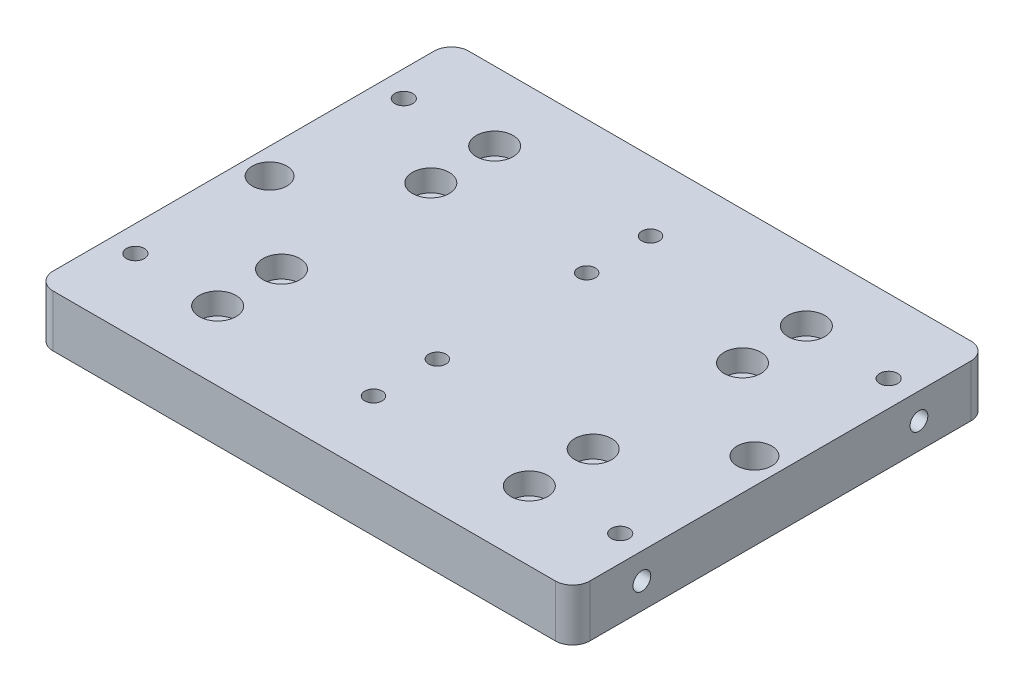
ISO-10303-21;
HEADER;
FILE_DESCRIPTION(('STEP AP214'),'2;1');
FILE_NAME('part.step','',(''),(''),'','','');
FILE_SCHEMA(('AUTOMOTIVE_DESIGN { 1 0 10303 214 1 1 1 1 }'));
ENDSEC;
DATA;
#1=APPLICATION_CONTEXT('core data for automotive mechanical design processes');
#2=APPLICATION_PROTOCOL_DEFINITION('international standard','automotive_design',2000,#1);
#3=PRODUCT_CONTEXT('',#1,'mechanical');
#4=PRODUCT('Part','Part','',(#3));
#5=PRODUCT_RELATED_PRODUCT_CATEGORY('part','',(#4));
#6=PRODUCT_DEFINITION_FORMATION('','',#4);
#7=PRODUCT_DEFINITION_CONTEXT('part definition',#1,'design');
#8=PRODUCT_DEFINITION('design','',#6,#7);
#9=PRODUCT_DEFINITION_SHAPE('','',#8);
#10=(LENGTH_UNIT() NAMED_UNIT(*) SI_UNIT(.MILLI.,.METRE.));
#11=(NAMED_UNIT(*) PLANE_ANGLE_UNIT() SI_UNIT($,.RADIAN.));
#12=(NAMED_UNIT(*) SI_UNIT($,.STERADIAN.) SOLID_ANGLE_UNIT());
#13=UNCERTAINTY_MEASURE_WITH_UNIT(LENGTH_MEASURE(1.E-05),#10,'distance_accuracy_value','');
#14=(GEOMETRIC_REPRESENTATION_CONTEXT(3) GLOBAL_UNCERTAINTY_ASSIGNED_CONTEXT((#13)) GLOBAL_UNIT_ASSIGNED_CONTEXT((#10,
#11,#12)) REPRESENTATION_CONTEXT('',''));
#15=CARTESIAN_POINT('',(0.,0.,0.));
#16=DIRECTION('',(0.,0.,1.));
#17=DIRECTION('',(1.,0.,0.));
#18=AXIS2_PLACEMENT_3D('',#15,#16,#17);
#19=CARTESIAN_POINT('',(98.425,19.05,-76.2));
#20=DIRECTION('',(-1.,0.,0.));
#21=DIRECTION('',(0.,0.,1.));
#22=AXIS2_PLACEMENT_3D('',#19,#20,#21);
#23=PLANE('',#22);
#24=CARTESIAN_POINT('',(98.425,9.52499999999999,50.799999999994));
#25=DIRECTION('',(1.,0.,0.));
#26=DIRECTION('',(0.,0.,-1.));
#27=AXIS2_PLACEMENT_3D('',#24,#25,#26);
#28=CIRCLE('',#27,3.2639);
#29=CARTESIAN_POINT('',(98.425,9.52499999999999,47.536099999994));
#30=VERTEX_POINT('',#29);
#31=EDGE_CURVE('E131',#30,#30,#28,.T.);
#32=ORIENTED_EDGE('',*,*,#31,.F.);
#33=EDGE_LOOP('',(#32));
#34=FACE_BOUND('',#33,.T.);
#35=CARTESIAN_POINT('',(98.425,9.525,-50.799999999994));
#36=DIRECTION('',(1.,0.,0.));
#37=DIRECTION('',(0.,0.,-1.));
#38=AXIS2_PLACEMENT_3D('',#35,#36,#37);
#39=CIRCLE('',#38,3.2639);
#40=CARTESIAN_POINT('',(98.425,9.525,-54.063899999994));
#41=VERTEX_POINT('',#40);
#42=EDGE_CURVE('E134',#41,#41,#39,.T.);
#43=ORIENTED_EDGE('',*,*,#42,.F.);
#44=EDGE_LOOP('',(#43));
#45=FACE_BOUND('',#44,.T.);
#46=DIRECTION('',(0.,0.,-1.));
#47=VECTOR('',#46,1.);
#48=CARTESIAN_POINT('',(98.425,0.,-76.2));
#49=LINE('',#48,#47);
#50=CARTESIAN_POINT('',(98.425,0.,69.85));
#51=VERTEX_POINT('',#50);
#52=CARTESIAN_POINT('',(98.425,0.,-69.85));
#53=VERTEX_POINT('',#52);
#54=EDGE_CURVE('E314',#51,#53,#49,.T.);
#55=ORIENTED_EDGE('',*,*,#54,.T.);
#56=DIRECTION('',(0.,-1.,0.));
#57=VECTOR('',#56,1.);
#58=CARTESIAN_POINT('',(98.425,19.05,-69.85));
#59=LINE('',#58,#57);
#60=CARTESIAN_POINT('',(98.425,19.05,-69.85));
#61=VERTEX_POINT('',#60);
#62=EDGE_CURVE('E11',#53,#61,#59,.F.);
#63=ORIENTED_EDGE('',*,*,#62,.T.);
#64=DIRECTION('',(0.,0.,-1.));
#65=VECTOR('',#64,1.);
#66=CARTESIAN_POINT('',(98.425,19.05,-76.2));
#67=LINE('',#66,#65);
#68=CARTESIAN_POINT('',(98.425,19.05,69.85));
#69=VERTEX_POINT('',#68);
#70=EDGE_CURVE('E315',#69,#61,#67,.T.);
#71=ORIENTED_EDGE('',*,*,#70,.F.);
#72=DIRECTION('',(0.,-1.,0.));
#73=VECTOR('',#72,1.);
#74=CARTESIAN_POINT('',(98.425,19.05,69.85));
#75=LINE('',#74,#73);
#76=EDGE_CURVE('E53',#69,#51,#75,.T.);
#77=ORIENTED_EDGE('',*,*,#76,.T.);
#78=EDGE_LOOP('',(#55,#63,#71,#77));
#79=FACE_BOUND('',#78,.T.);
#80=ADVANCED_FACE('F39',(#34,#45,#79),#23,.F.);
#81=CARTESIAN_POINT('',(-98.425,19.05,-76.2));
#82=DIRECTION('',(0.,0.,1.));
#83=DIRECTION('',(1.,0.,0.));
#84=AXIS2_PLACEMENT_3D('',#81,#82,#83);
#85=PLANE('',#84);
#86=DIRECTION('',(-1.,0.,0.));
#87=VECTOR('',#86,1.);
#88=CARTESIAN_POINT('',(-98.425,0.,-76.2));
#89=LINE('',#88,#87);
#90=CARTESIAN_POINT('',(92.075,0.,-76.2));
#91=VERTEX_POINT('',#90);
#92=CARTESIAN_POINT('',(-92.075,0.,-76.2));
#93=VERTEX_POINT('',#92);
#94=EDGE_CURVE('E329',#91,#93,#89,.T.);
#95=ORIENTED_EDGE('',*,*,#94,.T.);
#96=DIRECTION('',(0.,-1.,0.));
#97=VECTOR('',#96,1.);
#98=CARTESIAN_POINT('',(-92.075,19.05,-76.2));
#99=LINE('',#98,#97);
#100=CARTESIAN_POINT('',(-92.075,19.05,-76.2));
#101=VERTEX_POINT('',#100);
#102=EDGE_CURVE('E61',#93,#101,#99,.F.);
#103=ORIENTED_EDGE('',*,*,#102,.T.);
#104=DIRECTION('',(-1.,0.,0.));
#105=VECTOR('',#104,1.);
#106=CARTESIAN_POINT('',(-98.425,19.05,-76.2));
#107=LINE('',#106,#105);
#108=CARTESIAN_POINT('',(92.075,19.05,-76.2));
#109=VERTEX_POINT('',#108);
#110=EDGE_CURVE('E317',#109,#101,#107,.T.);
#111=ORIENTED_EDGE('',*,*,#110,.F.);
#112=DIRECTION('',(0.,-1.,0.));
#113=VECTOR('',#112,1.);
#114=CARTESIAN_POINT('',(92.075,19.05,-76.2));
#115=LINE('',#114,#113);
#116=EDGE_CURVE('E464',#109,#91,#115,.T.);
#117=ORIENTED_EDGE('',*,*,#116,.T.);
#118=EDGE_LOOP('',(#95,#103,#111,#117));
#119=FACE_BOUND('',#118,.T.);
#120=ADVANCED_FACE('F434',(#119),#85,.F.);
#121=CARTESIAN_POINT('',(-98.425,19.05,-76.2));
#122=DIRECTION('',(1.,0.,0.));
#123=DIRECTION('',(0.,0.,-1.));
#124=AXIS2_PLACEMENT_3D('',#121,#122,#123);
#125=PLANE('',#124);
#126=CARTESIAN_POINT('',(-98.425,9.52499999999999,50.799999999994));
#127=DIRECTION('',(-1.,0.,0.));
#128=DIRECTION('',(0.,0.,1.));
#129=AXIS2_PLACEMENT_3D('',#126,#127,#128);
#130=CIRCLE('',#129,3.2639);
#131=CARTESIAN_POINT('',(-98.425,9.52499999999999,54.063899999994));
#132=VERTEX_POINT('',#131);
#133=EDGE_CURVE('E144',#132,#132,#130,.T.);
#134=ORIENTED_EDGE('',*,*,#133,.F.);
#135=EDGE_LOOP('',(#134));
#136=FACE_BOUND('',#135,.T.);
#137=CARTESIAN_POINT('',(-98.425,9.525,-50.799999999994));
#138=DIRECTION('',(-1.,0.,0.));
#139=DIRECTION('',(0.,0.,1.));
#140=AXIS2_PLACEMENT_3D('',#137,#138,#139);
#141=CIRCLE('',#140,3.2639);
#142=CARTESIAN_POINT('',(-98.425,9.525,-47.536099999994));
#143=VERTEX_POINT('',#142);
#144=EDGE_CURVE('E151',#143,#143,#141,.T.);
#145=ORIENTED_EDGE('',*,*,#144,.F.);
#146=EDGE_LOOP('',(#145));
#147=FACE_BOUND('',#146,.T.);
#148=DIRECTION('',(0.,0.,1.));
#149=VECTOR('',#148,1.);
#150=CARTESIAN_POINT('',(-98.425,0.,-76.2));
#151=LINE('',#150,#149);
#152=CARTESIAN_POINT('',(-98.425,0.,-69.85));
#153=VERTEX_POINT('',#152);
#154=CARTESIAN_POINT('',(-98.425,0.,69.85));
#155=VERTEX_POINT('',#154);
#156=EDGE_CURVE('E331',#153,#155,#151,.T.);
#157=ORIENTED_EDGE('',*,*,#156,.T.);
#158=DIRECTION('',(0.,-1.,0.));
#159=VECTOR('',#158,1.);
#160=CARTESIAN_POINT('',(-98.425,19.05,69.85));
#161=LINE('',#160,#159);
#162=CARTESIAN_POINT('',(-98.425,19.05,69.85));
#163=VERTEX_POINT('',#162);
#164=EDGE_CURVE('E470',#155,#163,#161,.F.);
#165=ORIENTED_EDGE('',*,*,#164,.T.);
#166=DIRECTION('',(0.,0.,1.));
#167=VECTOR('',#166,1.);
#168=CARTESIAN_POINT('',(-98.425,19.05,-76.2));
#169=LINE('',#168,#167);
#170=CARTESIAN_POINT('',(-98.425,19.05,-69.85));
#171=VERTEX_POINT('',#170);
#172=EDGE_CURVE('E320',#171,#163,#169,.T.);
#173=ORIENTED_EDGE('',*,*,#172,.F.);
#174=DIRECTION('',(0.,-1.,0.));
#175=VECTOR('',#174,1.);
#176=CARTESIAN_POINT('',(-98.425,19.05,-69.85));
#177=LINE('',#176,#175);
#178=EDGE_CURVE('E560',#171,#153,#177,.T.);
#179=ORIENTED_EDGE('',*,*,#178,.T.);
#180=EDGE_LOOP('',(#157,#165,#173,#179));
#181=FACE_BOUND('',#180,.T.);
#182=ADVANCED_FACE('F440',(#136,#147,#181),#125,.F.);
#183=CARTESIAN_POINT('',(-98.425,19.05,76.2));
#184=DIRECTION('',(0.,0.,-1.));
#185=DIRECTION('',(-1.,0.,0.));
#186=AXIS2_PLACEMENT_3D('',#183,#184,#185);
#187=PLANE('',#186);
#188=DIRECTION('',(1.,0.,0.));
#189=VECTOR('',#188,1.);
#190=CARTESIAN_POINT('',(-98.425,19.05,76.2));
#191=LINE('',#190,#189);
#192=CARTESIAN_POINT('',(-92.075,19.05,76.2));
#193=VERTEX_POINT('',#192);
#194=CARTESIAN_POINT('',(92.075,19.05,76.2));
#195=VERTEX_POINT('',#194);
#196=EDGE_CURVE('E323',#193,#195,#191,.T.);
#197=ORIENTED_EDGE('',*,*,#196,.F.);
#198=DIRECTION('',(0.,-1.,0.));
#199=VECTOR('',#198,1.);
#200=CARTESIAN_POINT('',(-92.075,19.05,76.2));
#201=LINE('',#200,#199);
#202=CARTESIAN_POINT('',(-92.075,0.,76.2));
#203=VERTEX_POINT('',#202);
#204=EDGE_CURVE('E547',#193,#203,#201,.T.);
#205=ORIENTED_EDGE('',*,*,#204,.T.);
#206=DIRECTION('',(1.,0.,0.));
#207=VECTOR('',#206,1.);
#208=CARTESIAN_POINT('',(-98.425,0.,76.2));
#209=LINE('',#208,#207);
#210=CARTESIAN_POINT('',(92.075,0.,76.2));
#211=VERTEX_POINT('',#210);
#212=EDGE_CURVE('E318',#203,#211,#209,.T.);
#213=ORIENTED_EDGE('',*,*,#212,.T.);
#214=DIRECTION('',(0.,-1.,0.));
#215=VECTOR('',#214,1.);
#216=CARTESIAN_POINT('',(92.075,19.05,76.2));
#217=LINE('',#216,#215);
#218=EDGE_CURVE('E326',#211,#195,#217,.F.);
#219=ORIENTED_EDGE('',*,*,#218,.T.);
#220=EDGE_LOOP('',(#197,#205,#213,#219));
#221=FACE_BOUND('',#220,.T.);
#222=ADVANCED_FACE('F519',(#221),#187,.F.);
#223=CARTESIAN_POINT('',(0.,19.05,0.));
#224=DIRECTION('',(0.,1.,0.));
#225=DIRECTION('',(0.,0.,1.));
#226=AXIS2_PLACEMENT_3D('',#223,#224,#225);
#227=PLANE('',#226);
#228=CARTESIAN_POINT('',(-1.17240427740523E-13,19.05,-50.7999999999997));
#229=DIRECTION('',(0.,-1.,0.));
#230=DIRECTION('',(0.,0.,-1.));
#231=AXIS2_PLACEMENT_3D('',#228,#229,#230);
#232=CIRCLE('',#231,3.175);
#233=CARTESIAN_POINT('',(-1.17240427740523E-13,19.05,-53.9749999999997));
#234=VERTEX_POINT('',#233);
#235=EDGE_CURVE('E161',#234,#234,#232,.T.);
#236=ORIENTED_EDGE('',*,*,#235,.T.);
#237=EDGE_LOOP('',(#236));
#238=FACE_BOUND('',#237,.T.);
#239=CARTESIAN_POINT('',(-3.00588516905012E-13,19.05,50.8000000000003));
#240=DIRECTION('',(0.,-1.,0.));
#241=DIRECTION('',(0.,0.,-1.));
#242=AXIS2_PLACEMENT_3D('',#239,#240,#241);
#243=CIRCLE('',#242,3.175);
#244=CARTESIAN_POINT('',(-3.00588516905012E-13,19.05,47.6250000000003));
#245=VERTEX_POINT('',#244);
#246=EDGE_CURVE('E167',#245,#245,#243,.T.);
#247=ORIENTED_EDGE('',*,*,#246,.T.);
#248=EDGE_LOOP('',(#247));
#249=FACE_BOUND('',#248,.T.);
#250=CARTESIAN_POINT('',(57.1499999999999,19.05,-50.7999999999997));
#251=DIRECTION('',(0.,1.,0.));
#252=DIRECTION('',(0.,0.,1.));
#253=AXIS2_PLACEMENT_3D('',#250,#251,#252);
#254=CIRCLE('',#253,6.74751);
#255=CARTESIAN_POINT('',(57.1499999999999,19.05,-44.0524899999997));
#256=VERTEX_POINT('',#255);
#257=EDGE_CURVE('E170',#256,#256,#254,.T.);
#258=ORIENTED_EDGE('',*,*,#257,.F.);
#259=EDGE_LOOP('',(#258));
#260=FACE_BOUND('',#259,.T.);
#261=CARTESIAN_POINT('',(-57.1500000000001,19.05,-50.7999999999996));
#262=DIRECTION('',(0.,1.,0.));
#263=DIRECTION('',(0.,0.,1.));
#264=AXIS2_PLACEMENT_3D('',#261,#262,#263);
#265=CIRCLE('',#264,6.74751);
#266=CARTESIAN_POINT('',(-57.1500000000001,19.05,-44.0524899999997));
#267=VERTEX_POINT('',#266);
#268=EDGE_CURVE('E182',#267,#267,#265,.T.);
#269=ORIENTED_EDGE('',*,*,#268,.F.);
#270=EDGE_LOOP('',(#269));
#271=FACE_BOUND('',#270,.T.);
#272=CARTESIAN_POINT('',(-57.15,19.05,50.8000000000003));
#273=DIRECTION('',(0.,1.,0.));
#274=DIRECTION('',(0.,0.,1.));
#275=AXIS2_PLACEMENT_3D('',#272,#273,#274);
#276=CIRCLE('',#275,6.74751);
#277=CARTESIAN_POINT('',(-57.15,19.05,57.5475100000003));
#278=VERTEX_POINT('',#277);
#279=EDGE_CURVE('E194',#278,#278,#276,.T.);
#280=ORIENTED_EDGE('',*,*,#279,.F.);
#281=EDGE_LOOP('',(#280));
#282=FACE_BOUND('',#281,.T.);
#283=CARTESIAN_POINT('',(57.15,19.05,50.8000000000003));
#284=DIRECTION('',(0.,1.,0.));
#285=DIRECTION('',(0.,0.,1.));
#286=AXIS2_PLACEMENT_3D('',#283,#284,#285);
#287=CIRCLE('',#286,6.74751000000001);
#288=CARTESIAN_POINT('',(57.15,19.05,57.5475100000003));
#289=VERTEX_POINT('',#288);
#290=EDGE_CURVE('E206',#289,#289,#287,.T.);
#291=ORIENTED_EDGE('',*,*,#290,.F.);
#292=EDGE_LOOP('',(#291));
#293=FACE_BOUND('',#292,.T.);
#294=CARTESIAN_POINT('',(-88.9,19.05,0.));
#295=DIRECTION('',(0.,1.,0.));
#296=DIRECTION('',(0.,0.,1.));
#297=AXIS2_PLACEMENT_3D('',#294,#295,#296);
#298=CIRCLE('',#297,6.34999999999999);
#299=CARTESIAN_POINT('',(-88.9,19.05,6.34999999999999));
#300=VERTEX_POINT('',#299);
#301=EDGE_CURVE('E218',#300,#300,#298,.T.);
#302=ORIENTED_EDGE('',*,*,#301,.F.);
#303=EDGE_LOOP('',(#302));
#304=FACE_BOUND('',#303,.T.);
#305=CARTESIAN_POINT('',(88.9,19.05,0.));
#306=DIRECTION('',(0.,1.,0.));
#307=DIRECTION('',(0.,0.,1.));
#308=AXIS2_PLACEMENT_3D('',#305,#306,#307);
#309=CIRCLE('',#308,6.34999999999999);
#310=CARTESIAN_POINT('',(88.9,19.05,6.34999999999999));
#311=VERTEX_POINT('',#310);
#312=EDGE_CURVE('E224',#311,#311,#309,.T.);
#313=ORIENTED_EDGE('',*,*,#312,.F.);
#314=EDGE_LOOP('',(#313));
#315=FACE_BOUND('',#314,.T.);
#316=CARTESIAN_POINT('',(-88.9,19.05,-49.2124999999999));
#317=DIRECTION('',(0.,1.,0.));
#318=DIRECTION('',(0.,0.,1.));
#319=AXIS2_PLACEMENT_3D('',#316,#317,#318);
#320=CIRCLE('',#319,3.2639);
#321=CARTESIAN_POINT('',(-88.9,19.05,-45.9485999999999));
#322=VERTEX_POINT('',#321);
#323=EDGE_CURVE('E230',#322,#322,#320,.T.);
#324=ORIENTED_EDGE('',*,*,#323,.F.);
#325=EDGE_LOOP('',(#324));
#326=FACE_BOUND('',#325,.T.);
#327=CARTESIAN_POINT('',(-88.9,19.05,49.2125000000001));
#328=DIRECTION('',(0.,1.,0.));
#329=DIRECTION('',(0.,0.,1.));
#330=AXIS2_PLACEMENT_3D('',#327,#328,#329);
#331=CIRCLE('',#330,3.2639);
#332=CARTESIAN_POINT('',(-88.9,19.05,52.4764000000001));
#333=VERTEX_POINT('',#332);
#334=EDGE_CURVE('E236',#333,#333,#331,.T.);
#335=ORIENTED_EDGE('',*,*,#334,.F.);
#336=EDGE_LOOP('',(#335));
#337=FACE_BOUND('',#336,.T.);
#338=CARTESIAN_POINT('',(88.9,19.05,49.2125000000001));
#339=DIRECTION('',(0.,1.,0.));
#340=DIRECTION('',(0.,0.,1.));
#341=AXIS2_PLACEMENT_3D('',#338,#339,#340);
#342=CIRCLE('',#341,3.2639);
#343=CARTESIAN_POINT('',(88.9,19.05,52.4764000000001));
#344=VERTEX_POINT('',#343);
#345=EDGE_CURVE('E242',#344,#344,#342,.T.);
#346=ORIENTED_EDGE('',*,*,#345,.F.);
#347=EDGE_LOOP('',(#346));
#348=FACE_BOUND('',#347,.T.);
#349=CARTESIAN_POINT('',(88.9,19.05,-49.2124999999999));
#350=DIRECTION('',(0.,1.,0.));
#351=DIRECTION('',(0.,0.,1.));
#352=AXIS2_PLACEMENT_3D('',#349,#350,#351);
#353=CIRCLE('',#352,3.2639);
#354=CARTESIAN_POINT('',(88.9,19.05,-45.9485999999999));
#355=VERTEX_POINT('',#354);
#356=EDGE_CURVE('E248',#355,#355,#353,.T.);
#357=ORIENTED_EDGE('',*,*,#356,.F.);
#358=EDGE_LOOP('',(#357));
#359=FACE_BOUND('',#358,.T.);
#360=CARTESIAN_POINT('',(0.,19.05,27.3812));
#361=DIRECTION('',(0.,1.,0.));
#362=DIRECTION('',(0.,0.,1.));
#363=AXIS2_PLACEMENT_3D('',#360,#361,#362);
#364=CIRCLE('',#363,3.175);
#365=CARTESIAN_POINT('',(0.,19.05,30.5562));
#366=VERTEX_POINT('',#365);
#367=EDGE_CURVE('E254',#366,#366,#364,.T.);
#368=ORIENTED_EDGE('',*,*,#367,.F.);
#369=EDGE_LOOP('',(#368));
#370=FACE_BOUND('',#369,.T.);
#371=CARTESIAN_POINT('',(0.,19.05,-27.3812));
#372=DIRECTION('',(0.,1.,0.));
#373=DIRECTION('',(0.,0.,1.));
#374=AXIS2_PLACEMENT_3D('',#371,#372,#373);
#375=CIRCLE('',#374,3.175);
#376=CARTESIAN_POINT('',(0.,19.05,-24.2062));
#377=VERTEX_POINT('',#376);
#378=EDGE_CURVE('E260',#377,#377,#375,.T.);
#379=ORIENTED_EDGE('',*,*,#378,.F.);
#380=EDGE_LOOP('',(#379));
#381=FACE_BOUND('',#380,.T.);
#382=CARTESIAN_POINT('',(-57.15,19.05,-27.3812));
#383=DIRECTION('',(0.,1.,0.));
#384=DIRECTION('',(0.,0.,1.));
#385=AXIS2_PLACEMENT_3D('',#382,#383,#384);
#386=CIRCLE('',#385,6.74751);
#387=CARTESIAN_POINT('',(-57.15,19.05,-20.63369));
#388=VERTEX_POINT('',#387);
#389=EDGE_CURVE('E266',#388,#388,#386,.T.);
#390=ORIENTED_EDGE('',*,*,#389,.F.);
#391=EDGE_LOOP('',(#390));
#392=FACE_BOUND('',#391,.T.);
#393=CARTESIAN_POINT('',(57.15,19.05,-27.3812));
#394=DIRECTION('',(0.,1.,0.));
#395=DIRECTION('',(0.,0.,1.));
#396=AXIS2_PLACEMENT_3D('',#393,#394,#395);
#397=CIRCLE('',#396,6.74751);
#398=CARTESIAN_POINT('',(57.15,19.05,-20.63369));
#399=VERTEX_POINT('',#398);
#400=EDGE_CURVE('E278',#399,#399,#397,.T.);
#401=ORIENTED_EDGE('',*,*,#400,.F.);
#402=EDGE_LOOP('',(#401));
#403=FACE_BOUND('',#402,.T.);
#404=CARTESIAN_POINT('',(57.15,19.05,27.3812));
#405=DIRECTION('',(0.,1.,0.));
#406=DIRECTION('',(0.,0.,1.));
#407=AXIS2_PLACEMENT_3D('',#404,#405,#406);
#408=CIRCLE('',#407,6.74751);
#409=CARTESIAN_POINT('',(57.15,19.05,34.12871));
#410=VERTEX_POINT('',#409);
#411=EDGE_CURVE('E290',#410,#410,#408,.T.);
#412=ORIENTED_EDGE('',*,*,#411,.F.);
#413=EDGE_LOOP('',(#412));
#414=FACE_BOUND('',#413,.T.);
#415=CARTESIAN_POINT('',(-57.15,19.05,27.3812));
#416=DIRECTION('',(0.,1.,0.));
#417=DIRECTION('',(0.,0.,1.));
#418=AXIS2_PLACEMENT_3D('',#415,#416,#417);
#419=CIRCLE('',#418,6.74751);
#420=CARTESIAN_POINT('',(-57.15,19.05,34.12871));
#421=VERTEX_POINT('',#420);
#422=EDGE_CURVE('E302',#421,#421,#419,.T.);
#423=ORIENTED_EDGE('',*,*,#422,.F.);
#424=EDGE_LOOP('',(#423));
#425=FACE_BOUND('',#424,.T.);
#426=ORIENTED_EDGE('',*,*,#172,.T.);
#427=CARTESIAN_POINT('',(-92.075,19.05,69.85));
#428=DIRECTION('',(0.,1.,0.));
#429=DIRECTION('',(0.,0.,1.));
#430=AXIS2_PLACEMENT_3D('',#427,#428,#429);
#431=CIRCLE('',#430,6.35);
#432=EDGE_CURVE('E468',#163,#193,#431,.T.);
#433=ORIENTED_EDGE('',*,*,#432,.T.);
#434=ORIENTED_EDGE('',*,*,#196,.T.);
#435=CARTESIAN_POINT('',(92.075,19.05,69.85));
#436=DIRECTION('',(0.,1.,0.));
#437=DIRECTION('',(0.,0.,1.));
#438=AXIS2_PLACEMENT_3D('',#435,#436,#437);
#439=CIRCLE('',#438,6.35);
#440=EDGE_CURVE('E466',#195,#69,#439,.T.);
#441=ORIENTED_EDGE('',*,*,#440,.T.);
#442=ORIENTED_EDGE('',*,*,#70,.T.);
#443=CARTESIAN_POINT('',(92.075,19.05,-69.85));
#444=DIRECTION('',(0.,1.,0.));
#445=DIRECTION('',(0.,0.,1.));
#446=AXIS2_PLACEMENT_3D('',#443,#444,#445);
#447=CIRCLE('',#446,6.35);
#448=EDGE_CURVE('E68',#61,#109,#447,.T.);
#449=ORIENTED_EDGE('',*,*,#448,.T.);
#450=ORIENTED_EDGE('',*,*,#110,.T.);
#451=CARTESIAN_POINT('',(-92.075,19.05,-69.85));
#452=DIRECTION('',(0.,1.,0.));
#453=DIRECTION('',(0.,0.,1.));
#454=AXIS2_PLACEMENT_3D('',#451,#452,#453);
#455=CIRCLE('',#454,6.35);
#456=EDGE_CURVE('E465',#101,#171,#455,.T.);
#457=ORIENTED_EDGE('',*,*,#456,.T.);
#458=EDGE_LOOP('',(#426,#433,#434,#441,#442,#449,#450,#457));
#459=FACE_BOUND('',#458,.T.);
#460=ADVANCED_FACE('F515',(#238,#249,#260,#271,#282,#293,#304,#315,#326,#337,#348,#359,#370,
#381,#392,#403,#414,#425,#459),#227,.T.);
#461=CARTESIAN_POINT('',(0.,0.,0.));
#462=DIRECTION('',(0.,1.,0.));
#463=DIRECTION('',(0.,0.,1.));
#464=AXIS2_PLACEMENT_3D('',#461,#462,#463);
#465=PLANE('',#464);
#466=CARTESIAN_POINT('',(-1.17240427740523E-13,0.,-50.7999999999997));
#467=DIRECTION('',(0.,-1.,0.));
#468=DIRECTION('',(0.,0.,-1.));
#469=AXIS2_PLACEMENT_3D('',#466,#467,#468);
#470=CIRCLE('',#469,3.175);
#471=CARTESIAN_POINT('',(-1.17240427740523E-13,0.,-53.9749999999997));
#472=VERTEX_POINT('',#471);
#473=EDGE_CURVE('E158',#472,#472,#470,.T.);
#474=ORIENTED_EDGE('',*,*,#473,.F.);
#475=EDGE_LOOP('',(#474));
#476=FACE_BOUND('',#475,.T.);
#477=CARTESIAN_POINT('',(-3.00588516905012E-13,0.,50.8000000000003));
#478=DIRECTION('',(0.,-1.,0.));
#479=DIRECTION('',(0.,0.,-1.));
#480=AXIS2_PLACEMENT_3D('',#477,#478,#479);
#481=CIRCLE('',#480,3.175);
#482=CARTESIAN_POINT('',(-3.00588516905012E-13,0.,47.6250000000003));
#483=VERTEX_POINT('',#482);
#484=EDGE_CURVE('E164',#483,#483,#481,.T.);
#485=ORIENTED_EDGE('',*,*,#484,.F.);
#486=EDGE_LOOP('',(#485));
#487=FACE_BOUND('',#486,.T.);
#488=CARTESIAN_POINT('',(57.1499999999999,0.,-50.7999999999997));
#489=DIRECTION('',(0.,1.,0.));
#490=DIRECTION('',(0.,0.,1.));
#491=AXIS2_PLACEMENT_3D('',#488,#489,#490);
#492=CIRCLE('',#491,4.21639999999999);
#493=CARTESIAN_POINT('',(57.1499999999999,0.,-46.5835999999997));
#494=VERTEX_POINT('',#493);
#495=EDGE_CURVE('E179',#494,#494,#492,.T.);
#496=ORIENTED_EDGE('',*,*,#495,.T.);
#497=EDGE_LOOP('',(#496));
#498=FACE_BOUND('',#497,.T.);
#499=CARTESIAN_POINT('',(-57.1500000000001,0.,-50.7999999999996));
#500=DIRECTION('',(0.,1.,0.));
#501=DIRECTION('',(0.,0.,1.));
#502=AXIS2_PLACEMENT_3D('',#499,#500,#501);
#503=CIRCLE('',#502,4.21639999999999);
#504=CARTESIAN_POINT('',(-57.1500000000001,0.,-46.5835999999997));
#505=VERTEX_POINT('',#504);
#506=EDGE_CURVE('E191',#505,#505,#503,.T.);
#507=ORIENTED_EDGE('',*,*,#506,.T.);
#508=EDGE_LOOP('',(#507));
#509=FACE_BOUND('',#508,.T.);
#510=CARTESIAN_POINT('',(-57.15,0.,50.8000000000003));
#511=DIRECTION('',(0.,1.,0.));
#512=DIRECTION('',(0.,0.,1.));
#513=AXIS2_PLACEMENT_3D('',#510,#511,#512);
#514=CIRCLE('',#513,4.21639999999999);
#515=CARTESIAN_POINT('',(-57.15,0.,55.0164000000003));
#516=VERTEX_POINT('',#515);
#517=EDGE_CURVE('E203',#516,#516,#514,.T.);
#518=ORIENTED_EDGE('',*,*,#517,.T.);
#519=EDGE_LOOP('',(#518));
#520=FACE_BOUND('',#519,.T.);
#521=CARTESIAN_POINT('',(57.15,0.,50.8000000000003));
#522=DIRECTION('',(0.,1.,0.));
#523=DIRECTION('',(0.,0.,1.));
#524=AXIS2_PLACEMENT_3D('',#521,#522,#523);
#525=CIRCLE('',#524,4.21639999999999);
#526=CARTESIAN_POINT('',(57.15,0.,55.0164000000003));
#527=VERTEX_POINT('',#526);
#528=EDGE_CURVE('E215',#527,#527,#525,.T.);
#529=ORIENTED_EDGE('',*,*,#528,.T.);
#530=EDGE_LOOP('',(#529));
#531=FACE_BOUND('',#530,.T.);
#532=CARTESIAN_POINT('',(-88.9,0.,0.));
#533=DIRECTION('',(0.,1.,0.));
#534=DIRECTION('',(0.,0.,1.));
#535=AXIS2_PLACEMENT_3D('',#532,#533,#534);
#536=CIRCLE('',#535,6.34999999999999);
#537=CARTESIAN_POINT('',(-88.9,0.,6.34999999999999));
#538=VERTEX_POINT('',#537);
#539=EDGE_CURVE('E221',#538,#538,#536,.T.);
#540=ORIENTED_EDGE('',*,*,#539,.T.);
#541=EDGE_LOOP('',(#540));
#542=FACE_BOUND('',#541,.T.);
#543=CARTESIAN_POINT('',(88.9,0.,0.));
#544=DIRECTION('',(0.,1.,0.));
#545=DIRECTION('',(0.,0.,1.));
#546=AXIS2_PLACEMENT_3D('',#543,#544,#545);
#547=CIRCLE('',#546,6.34999999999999);
#548=CARTESIAN_POINT('',(88.9,0.,6.34999999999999));
#549=VERTEX_POINT('',#548);
#550=EDGE_CURVE('E227',#549,#549,#547,.T.);
#551=ORIENTED_EDGE('',*,*,#550,.T.);
#552=EDGE_LOOP('',(#551));
#553=FACE_BOUND('',#552,.T.);
#554=CARTESIAN_POINT('',(-88.9,0.,-49.2124999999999));
#555=DIRECTION('',(0.,1.,0.));
#556=DIRECTION('',(0.,0.,1.));
#557=AXIS2_PLACEMENT_3D('',#554,#555,#556);
#558=CIRCLE('',#557,3.2639);
#559=CARTESIAN_POINT('',(-88.9,0.,-45.9485999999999));
#560=VERTEX_POINT('',#559);
#561=EDGE_CURVE('E233',#560,#560,#558,.T.);
#562=ORIENTED_EDGE('',*,*,#561,.T.);
#563=EDGE_LOOP('',(#562));
#564=FACE_BOUND('',#563,.T.);
#565=CARTESIAN_POINT('',(-88.9,0.,49.2125000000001));
#566=DIRECTION('',(0.,1.,0.));
#567=DIRECTION('',(0.,0.,1.));
#568=AXIS2_PLACEMENT_3D('',#565,#566,#567);
#569=CIRCLE('',#568,3.2639);
#570=CARTESIAN_POINT('',(-88.9,0.,52.4764000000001));
#571=VERTEX_POINT('',#570);
#572=EDGE_CURVE('E239',#571,#571,#569,.T.);
#573=ORIENTED_EDGE('',*,*,#572,.T.);
#574=EDGE_LOOP('',(#573));
#575=FACE_BOUND('',#574,.T.);
#576=CARTESIAN_POINT('',(88.9,0.,49.2125000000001));
#577=DIRECTION('',(0.,1.,0.));
#578=DIRECTION('',(0.,0.,1.));
#579=AXIS2_PLACEMENT_3D('',#576,#577,#578);
#580=CIRCLE('',#579,3.2639);
#581=CARTESIAN_POINT('',(88.9,0.,52.4764000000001));
#582=VERTEX_POINT('',#581);
#583=EDGE_CURVE('E245',#582,#582,#580,.T.);
#584=ORIENTED_EDGE('',*,*,#583,.T.);
#585=EDGE_LOOP('',(#584));
#586=FACE_BOUND('',#585,.T.);
#587=CARTESIAN_POINT('',(88.9,0.,-49.2124999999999));
#588=DIRECTION('',(0.,1.,0.));
#589=DIRECTION('',(0.,0.,1.));
#590=AXIS2_PLACEMENT_3D('',#587,#588,#589);
#591=CIRCLE('',#590,3.2639);
#592=CARTESIAN_POINT('',(88.9,0.,-45.9485999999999));
#593=VERTEX_POINT('',#592);
#594=EDGE_CURVE('E251',#593,#593,#591,.T.);
#595=ORIENTED_EDGE('',*,*,#594,.T.);
#596=EDGE_LOOP('',(#595));
#597=FACE_BOUND('',#596,.T.);
#598=CARTESIAN_POINT('',(0.,0.,27.3812));
#599=DIRECTION('',(0.,1.,0.));
#600=DIRECTION('',(0.,0.,1.));
#601=AXIS2_PLACEMENT_3D('',#598,#599,#600);
#602=CIRCLE('',#601,3.175);
#603=CARTESIAN_POINT('',(0.,0.,30.5562));
#604=VERTEX_POINT('',#603);
#605=EDGE_CURVE('E257',#604,#604,#602,.T.);
#606=ORIENTED_EDGE('',*,*,#605,.T.);
#607=EDGE_LOOP('',(#606));
#608=FACE_BOUND('',#607,.T.);
#609=CARTESIAN_POINT('',(0.,0.,-27.3812));
#610=DIRECTION('',(0.,1.,0.));
#611=DIRECTION('',(0.,0.,1.));
#612=AXIS2_PLACEMENT_3D('',#609,#610,#611);
#613=CIRCLE('',#612,3.175);
#614=CARTESIAN_POINT('',(0.,0.,-24.2062));
#615=VERTEX_POINT('',#614);
#616=EDGE_CURVE('E263',#615,#615,#613,.T.);
#617=ORIENTED_EDGE('',*,*,#616,.T.);
#618=EDGE_LOOP('',(#617));
#619=FACE_BOUND('',#618,.T.);
#620=CARTESIAN_POINT('',(-57.15,0.,-27.3812));
#621=DIRECTION('',(0.,1.,0.));
#622=DIRECTION('',(0.,0.,1.));
#623=AXIS2_PLACEMENT_3D('',#620,#621,#622);
#624=CIRCLE('',#623,4.21639999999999);
#625=CARTESIAN_POINT('',(-57.15,0.,-23.1648));
#626=VERTEX_POINT('',#625);
#627=EDGE_CURVE('E275',#626,#626,#624,.T.);
#628=ORIENTED_EDGE('',*,*,#627,.T.);
#629=EDGE_LOOP('',(#628));
#630=FACE_BOUND('',#629,.T.);
#631=CARTESIAN_POINT('',(57.15,0.,-27.3812));
#632=DIRECTION('',(0.,1.,0.));
#633=DIRECTION('',(0.,0.,1.));
#634=AXIS2_PLACEMENT_3D('',#631,#632,#633);
#635=CIRCLE('',#634,4.21639999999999);
#636=CARTESIAN_POINT('',(57.15,0.,-23.1648));
#637=VERTEX_POINT('',#636);
#638=EDGE_CURVE('E287',#637,#637,#635,.T.);
#639=ORIENTED_EDGE('',*,*,#638,.T.);
#640=EDGE_LOOP('',(#639));
#641=FACE_BOUND('',#640,.T.);
#642=CARTESIAN_POINT('',(57.15,0.,27.3812));
#643=DIRECTION('',(0.,1.,0.));
#644=DIRECTION('',(0.,0.,1.));
#645=AXIS2_PLACEMENT_3D('',#642,#643,#644);
#646=CIRCLE('',#645,4.21639999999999);
#647=CARTESIAN_POINT('',(57.15,0.,31.5976));
#648=VERTEX_POINT('',#647);
#649=EDGE_CURVE('E299',#648,#648,#646,.T.);
#650=ORIENTED_EDGE('',*,*,#649,.T.);
#651=EDGE_LOOP('',(#650));
#652=FACE_BOUND('',#651,.T.);
#653=CARTESIAN_POINT('',(-57.15,0.,27.3812));
#654=DIRECTION('',(0.,1.,0.));
#655=DIRECTION('',(0.,0.,1.));
#656=AXIS2_PLACEMENT_3D('',#653,#654,#655);
#657=CIRCLE('',#656,4.21639999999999);
#658=CARTESIAN_POINT('',(-57.15,0.,31.5976));
#659=VERTEX_POINT('',#658);
#660=EDGE_CURVE('E311',#659,#659,#657,.T.);
#661=ORIENTED_EDGE('',*,*,#660,.T.);
#662=EDGE_LOOP('',(#661));
#663=FACE_BOUND('',#662,.T.);
#664=ORIENTED_EDGE('',*,*,#212,.F.);
#665=CARTESIAN_POINT('',(-92.075,0.,69.85));
#666=DIRECTION('',(0.,1.,0.));
#667=DIRECTION('',(0.,0.,1.));
#668=AXIS2_PLACEMENT_3D('',#665,#666,#667);
#669=CIRCLE('',#668,6.35);
#670=EDGE_CURVE('E548',#203,#155,#669,.F.);
#671=ORIENTED_EDGE('',*,*,#670,.T.);
#672=ORIENTED_EDGE('',*,*,#156,.F.);
#673=CARTESIAN_POINT('',(-92.075,0.,-69.85));
#674=DIRECTION('',(0.,1.,0.));
#675=DIRECTION('',(0.,0.,1.));
#676=AXIS2_PLACEMENT_3D('',#673,#674,#675);
#677=CIRCLE('',#676,6.35);
#678=EDGE_CURVE('E557',#153,#93,#677,.F.);
#679=ORIENTED_EDGE('',*,*,#678,.T.);
#680=ORIENTED_EDGE('',*,*,#94,.F.);
#681=CARTESIAN_POINT('',(92.075,0.,-69.85));
#682=DIRECTION('',(0.,1.,0.));
#683=DIRECTION('',(0.,0.,1.));
#684=AXIS2_PLACEMENT_3D('',#681,#682,#683);
#685=CIRCLE('',#684,6.35);
#686=EDGE_CURVE('E553',#91,#53,#685,.F.);
#687=ORIENTED_EDGE('',*,*,#686,.T.);
#688=ORIENTED_EDGE('',*,*,#54,.F.);
#689=CARTESIAN_POINT('',(92.075,0.,69.85));
#690=DIRECTION('',(0.,1.,0.));
#691=DIRECTION('',(0.,0.,1.));
#692=AXIS2_PLACEMENT_3D('',#689,#690,#691);
#693=CIRCLE('',#692,6.35);
#694=EDGE_CURVE('E551',#51,#211,#693,.F.);
#695=ORIENTED_EDGE('',*,*,#694,.T.);
#696=EDGE_LOOP('',(#664,#671,#672,#679,#680,#687,#688,#695));
#697=FACE_BOUND('',#696,.T.);
#698=ADVANCED_FACE('F518',(#476,#487,#498,#509,#520,#531,#542,#553,#564,#575,#586,#597,#608,
#619,#630,#641,#652,#663,#697),#465,.F.);
#699=CARTESIAN_POINT('',(-57.15,19.05,27.3812));
#700=DIRECTION('',(0.,1.,0.));
#701=DIRECTION('',(0.,0.,1.));
#702=AXIS2_PLACEMENT_3D('',#699,#700,#701);
#703=CYLINDRICAL_SURFACE('',#702,4.2164);
#704=ORIENTED_EDGE('',*,*,#660,.F.);
#705=EDGE_LOOP('',(#704));
#706=FACE_BOUND('',#705,.T.);
#707=CARTESIAN_POINT('',(-57.15,11.1125,27.3812));
#708=DIRECTION('',(0.,1.,0.));
#709=DIRECTION('',(0.,0.,1.));
#710=AXIS2_PLACEMENT_3D('',#707,#708,#709);
#711=CIRCLE('',#710,4.2164);
#712=CARTESIAN_POINT('',(-57.15,11.1125,31.5976));
#713=VERTEX_POINT('',#712);
#714=EDGE_CURVE('E308',#713,#713,#711,.T.);
#715=ORIENTED_EDGE('',*,*,#714,.T.);
#716=EDGE_LOOP('',(#715));
#717=FACE_BOUND('',#716,.T.);
#718=ADVANCED_FACE('F578',(#706,#717),#703,.F.);
#719=CARTESIAN_POINT('',(-52.9336,11.1125,27.3812));
#720=DIRECTION('',(0.,-1.,0.));
#721=DIRECTION('',(0.,0.,-1.));
#722=AXIS2_PLACEMENT_3D('',#719,#720,#721);
#723=PLANE('',#722);
#724=ORIENTED_EDGE('',*,*,#714,.F.);
#725=EDGE_LOOP('',(#724));
#726=FACE_BOUND('',#725,.T.);
#727=CARTESIAN_POINT('',(-57.15,11.1125,27.3812));
#728=DIRECTION('',(0.,1.,0.));
#729=DIRECTION('',(0.,0.,1.));
#730=AXIS2_PLACEMENT_3D('',#727,#728,#729);
#731=CIRCLE('',#730,6.74751);
#732=CARTESIAN_POINT('',(-57.15,11.1125,34.12871));
#733=VERTEX_POINT('',#732);
#734=EDGE_CURVE('E305',#733,#733,#731,.T.);
#735=ORIENTED_EDGE('',*,*,#734,.T.);
#736=EDGE_LOOP('',(#735));
#737=FACE_BOUND('',#736,.T.);
#738=ADVANCED_FACE('F583',(#726,#737),#723,.F.);
#739=CARTESIAN_POINT('',(-57.15,19.05,27.3812));
#740=DIRECTION('',(0.,1.,0.));
#741=DIRECTION('',(0.,0.,1.));
#742=AXIS2_PLACEMENT_3D('',#739,#740,#741);
#743=CYLINDRICAL_SURFACE('',#742,6.74751);
#744=ORIENTED_EDGE('',*,*,#734,.F.);
#745=EDGE_LOOP('',(#744));
#746=FACE_BOUND('',#745,.T.);
#747=ORIENTED_EDGE('',*,*,#422,.T.);
#748=EDGE_LOOP('',(#747));
#749=FACE_BOUND('',#748,.T.);
#750=ADVANCED_FACE('F587',(#746,#749),#743,.F.);
#751=CARTESIAN_POINT('',(57.15,19.05,27.3812));
#752=DIRECTION('',(0.,1.,0.));
#753=DIRECTION('',(0.,0.,1.));
#754=AXIS2_PLACEMENT_3D('',#751,#752,#753);
#755=CYLINDRICAL_SURFACE('',#754,4.2164);
#756=ORIENTED_EDGE('',*,*,#649,.F.);
#757=EDGE_LOOP('',(#756));
#758=FACE_BOUND('',#757,.T.);
#759=CARTESIAN_POINT('',(57.15,11.1125,27.3812));
#760=DIRECTION('',(0.,1.,0.));
#761=DIRECTION('',(0.,0.,1.));
#762=AXIS2_PLACEMENT_3D('',#759,#760,#761);
#763=CIRCLE('',#762,4.2164);
#764=CARTESIAN_POINT('',(57.15,11.1125,31.5976));
#765=VERTEX_POINT('',#764);
#766=EDGE_CURVE('E296',#765,#765,#763,.T.);
#767=ORIENTED_EDGE('',*,*,#766,.T.);
#768=EDGE_LOOP('',(#767));
#769=FACE_BOUND('',#768,.T.);
#770=ADVANCED_FACE('F591',(#758,#769),#755,.F.);
#771=CARTESIAN_POINT('',(61.3664,11.1125,27.3812));
#772=DIRECTION('',(0.,-1.,0.));
#773=DIRECTION('',(0.,0.,-1.));
#774=AXIS2_PLACEMENT_3D('',#771,#772,#773);
#775=PLANE('',#774);
#776=ORIENTED_EDGE('',*,*,#766,.F.);
#777=EDGE_LOOP('',(#776));
#778=FACE_BOUND('',#777,.T.);
#779=CARTESIAN_POINT('',(57.15,11.1125,27.3812));
#780=DIRECTION('',(0.,1.,0.));
#781=DIRECTION('',(0.,0.,1.));
#782=AXIS2_PLACEMENT_3D('',#779,#780,#781);
#783=CIRCLE('',#782,6.74751);
#784=CARTESIAN_POINT('',(57.15,11.1125,34.12871));
#785=VERTEX_POINT('',#784);
#786=EDGE_CURVE('E293',#785,#785,#783,.T.);
#787=ORIENTED_EDGE('',*,*,#786,.T.);
#788=EDGE_LOOP('',(#787));
#789=FACE_BOUND('',#788,.T.);
#790=ADVANCED_FACE('F595',(#778,#789),#775,.F.);
#791=CARTESIAN_POINT('',(57.15,19.05,27.3812));
#792=DIRECTION('',(0.,1.,0.));
#793=DIRECTION('',(0.,0.,1.));
#794=AXIS2_PLACEMENT_3D('',#791,#792,#793);
#795=CYLINDRICAL_SURFACE('',#794,6.74751);
#796=ORIENTED_EDGE('',*,*,#786,.F.);
#797=EDGE_LOOP('',(#796));
#798=FACE_BOUND('',#797,.T.);
#799=ORIENTED_EDGE('',*,*,#411,.T.);
#800=EDGE_LOOP('',(#799));
#801=FACE_BOUND('',#800,.T.);
#802=ADVANCED_FACE('F599',(#798,#801),#795,.F.);
#803=CARTESIAN_POINT('',(57.15,19.05,-27.3812));
#804=DIRECTION('',(0.,1.,0.));
#805=DIRECTION('',(0.,0.,1.));
#806=AXIS2_PLACEMENT_3D('',#803,#804,#805);
#807=CYLINDRICAL_SURFACE('',#806,4.2164);
#808=ORIENTED_EDGE('',*,*,#638,.F.);
#809=EDGE_LOOP('',(#808));
#810=FACE_BOUND('',#809,.T.);
#811=CARTESIAN_POINT('',(57.15,11.1125,-27.3812));
#812=DIRECTION('',(0.,1.,0.));
#813=DIRECTION('',(0.,0.,1.));
#814=AXIS2_PLACEMENT_3D('',#811,#812,#813);
#815=CIRCLE('',#814,4.2164);
#816=CARTESIAN_POINT('',(57.15,11.1125,-23.1648));
#817=VERTEX_POINT('',#816);
#818=EDGE_CURVE('E284',#817,#817,#815,.T.);
#819=ORIENTED_EDGE('',*,*,#818,.T.);
#820=EDGE_LOOP('',(#819));
#821=FACE_BOUND('',#820,.T.);
#822=ADVANCED_FACE('F603',(#810,#821),#807,.F.);
#823=CARTESIAN_POINT('',(61.3664,11.1125,-27.3812));
#824=DIRECTION('',(0.,-1.,0.));
#825=DIRECTION('',(0.,0.,-1.));
#826=AXIS2_PLACEMENT_3D('',#823,#824,#825);
#827=PLANE('',#826);
#828=ORIENTED_EDGE('',*,*,#818,.F.);
#829=EDGE_LOOP('',(#828));
#830=FACE_BOUND('',#829,.T.);
#831=CARTESIAN_POINT('',(57.15,11.1125,-27.3812));
#832=DIRECTION('',(0.,1.,0.));
#833=DIRECTION('',(0.,0.,1.));
#834=AXIS2_PLACEMENT_3D('',#831,#832,#833);
#835=CIRCLE('',#834,6.74751);
#836=CARTESIAN_POINT('',(57.15,11.1125,-20.63369));
#837=VERTEX_POINT('',#836);
#838=EDGE_CURVE('E281',#837,#837,#835,.T.);
#839=ORIENTED_EDGE('',*,*,#838,.T.);
#840=EDGE_LOOP('',(#839));
#841=FACE_BOUND('',#840,.T.);
#842=ADVANCED_FACE('F607',(#830,#841),#827,.F.);
#843=CARTESIAN_POINT('',(57.15,19.05,-27.3812));
#844=DIRECTION('',(0.,1.,0.));
#845=DIRECTION('',(0.,0.,1.));
#846=AXIS2_PLACEMENT_3D('',#843,#844,#845);
#847=CYLINDRICAL_SURFACE('',#846,6.74751);
#848=ORIENTED_EDGE('',*,*,#838,.F.);
#849=EDGE_LOOP('',(#848));
#850=FACE_BOUND('',#849,.T.);
#851=ORIENTED_EDGE('',*,*,#400,.T.);
#852=EDGE_LOOP('',(#851));
#853=FACE_BOUND('',#852,.T.);
#854=ADVANCED_FACE('F611',(#850,#853),#847,.F.);
#855=CARTESIAN_POINT('',(-57.15,19.05,-27.3812));
#856=DIRECTION('',(0.,1.,0.));
#857=DIRECTION('',(0.,0.,1.));
#858=AXIS2_PLACEMENT_3D('',#855,#856,#857);
#859=CYLINDRICAL_SURFACE('',#858,4.2164);
#860=ORIENTED_EDGE('',*,*,#627,.F.);
#861=EDGE_LOOP('',(#860));
#862=FACE_BOUND('',#861,.T.);
#863=CARTESIAN_POINT('',(-57.15,11.1125,-27.3812));
#864=DIRECTION('',(0.,1.,0.));
#865=DIRECTION('',(0.,0.,1.));
#866=AXIS2_PLACEMENT_3D('',#863,#864,#865);
#867=CIRCLE('',#866,4.2164);
#868=CARTESIAN_POINT('',(-57.15,11.1125,-23.1648));
#869=VERTEX_POINT('',#868);
#870=EDGE_CURVE('E272',#869,#869,#867,.T.);
#871=ORIENTED_EDGE('',*,*,#870,.T.);
#872=EDGE_LOOP('',(#871));
#873=FACE_BOUND('',#872,.T.);
#874=ADVANCED_FACE('F615',(#862,#873),#859,.F.);
#875=CARTESIAN_POINT('',(-52.9336,11.1125,-27.3812));
#876=DIRECTION('',(0.,-1.,0.));
#877=DIRECTION('',(0.,0.,-1.));
#878=AXIS2_PLACEMENT_3D('',#875,#876,#877);
#879=PLANE('',#878);
#880=ORIENTED_EDGE('',*,*,#870,.F.);
#881=EDGE_LOOP('',(#880));
#882=FACE_BOUND('',#881,.T.);
#883=CARTESIAN_POINT('',(-57.15,11.1125,-27.3812));
#884=DIRECTION('',(0.,1.,0.));
#885=DIRECTION('',(0.,0.,1.));
#886=AXIS2_PLACEMENT_3D('',#883,#884,#885);
#887=CIRCLE('',#886,6.74751);
#888=CARTESIAN_POINT('',(-57.15,11.1125,-20.63369));
#889=VERTEX_POINT('',#888);
#890=EDGE_CURVE('E269',#889,#889,#887,.T.);
#891=ORIENTED_EDGE('',*,*,#890,.T.);
#892=EDGE_LOOP('',(#891));
#893=FACE_BOUND('',#892,.T.);
#894=ADVANCED_FACE('F619',(#882,#893),#879,.F.);
#895=CARTESIAN_POINT('',(-57.15,19.05,-27.3812));
#896=DIRECTION('',(0.,1.,0.));
#897=DIRECTION('',(0.,0.,1.));
#898=AXIS2_PLACEMENT_3D('',#895,#896,#897);
#899=CYLINDRICAL_SURFACE('',#898,6.74751);
#900=ORIENTED_EDGE('',*,*,#890,.F.);
#901=EDGE_LOOP('',(#900));
#902=FACE_BOUND('',#901,.T.);
#903=ORIENTED_EDGE('',*,*,#389,.T.);
#904=EDGE_LOOP('',(#903));
#905=FACE_BOUND('',#904,.T.);
#906=ADVANCED_FACE('F623',(#902,#905),#899,.F.);
#907=CARTESIAN_POINT('',(0.,19.05,-27.3812));
#908=DIRECTION('',(0.,1.,0.));
#909=DIRECTION('',(0.,0.,1.));
#910=AXIS2_PLACEMENT_3D('',#907,#908,#909);
#911=CYLINDRICAL_SURFACE('',#910,3.175);
#912=ORIENTED_EDGE('',*,*,#616,.F.);
#913=EDGE_LOOP('',(#912));
#914=FACE_BOUND('',#913,.T.);
#915=ORIENTED_EDGE('',*,*,#378,.T.);
#916=EDGE_LOOP('',(#915));
#917=FACE_BOUND('',#916,.T.);
#918=ADVANCED_FACE('F627',(#914,#917),#911,.F.);
#919=CARTESIAN_POINT('',(0.,19.05,27.3812));
#920=DIRECTION('',(0.,1.,0.));
#921=DIRECTION('',(0.,0.,1.));
#922=AXIS2_PLACEMENT_3D('',#919,#920,#921);
#923=CYLINDRICAL_SURFACE('',#922,3.175);
#924=ORIENTED_EDGE('',*,*,#605,.F.);
#925=EDGE_LOOP('',(#924));
#926=FACE_BOUND('',#925,.T.);
#927=ORIENTED_EDGE('',*,*,#367,.T.);
#928=EDGE_LOOP('',(#927));
#929=FACE_BOUND('',#928,.T.);
#930=ADVANCED_FACE('F630',(#926,#929),#923,.F.);
#931=CARTESIAN_POINT('',(88.9,19.05,-49.2124999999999));
#932=DIRECTION('',(0.,1.,0.));
#933=DIRECTION('',(0.,0.,1.));
#934=AXIS2_PLACEMENT_3D('',#931,#932,#933);
#935=CYLINDRICAL_SURFACE('',#934,3.2639);
#936=CARTESIAN_POINT('',(88.9,6.72451321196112,-52.4763999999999));
#937=CARTESIAN_POINT('',(88.8134897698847,6.72451157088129,-52.4763991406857));
#938=CARTESIAN_POINT('',(88.7269514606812,6.72244166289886,-52.4729543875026));
#939=CARTESIAN_POINT('',(88.5545726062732,6.71429122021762,-52.4592228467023));
#940=CARTESIAN_POINT('',(88.4687325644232,6.70820801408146,-52.4489315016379));
#941=CARTESIAN_POINT('',(88.2982694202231,6.69239474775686,-52.4216164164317));
#942=CARTESIAN_POINT('',(88.2136495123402,6.68265646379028,-52.4045774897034));
#943=CARTESIAN_POINT('',(88.0463919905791,6.66011770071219,-52.3639783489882));
#944=CARTESIAN_POINT('',(87.9637553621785,6.64731573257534,-52.3404149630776));
#945=CARTESIAN_POINT('',(87.7207913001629,6.60557111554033,-52.2606762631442));
#946=CARTESIAN_POINT('',(87.5640083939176,6.57313936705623,-52.1952227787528));
#947=CARTESIAN_POINT('',(87.263049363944,6.50518374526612,-52.0412991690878));
#948=CARTESIAN_POINT('',(87.1188789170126,6.4696584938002,-51.9528187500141));
#949=CARTESIAN_POINT('',(86.8322770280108,6.39868020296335,-51.7446389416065));
#950=CARTESIAN_POINT('',(86.6913033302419,6.36355262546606,-51.6227765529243));
#951=CARTESIAN_POINT('',(86.49621996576,6.32026023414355,-51.4223847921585));
#952=CARTESIAN_POINT('',(86.4339310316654,6.30739734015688,-51.3526680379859));
#953=CARTESIAN_POINT('',(86.3152934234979,6.285843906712,-51.2077689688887));
#954=CARTESIAN_POINT('',(86.2589425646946,6.27715182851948,-51.1325886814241));
#955=CARTESIAN_POINT('',(86.1260797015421,6.261937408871,-50.938284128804));
#956=CARTESIAN_POINT('',(86.0536404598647,6.25869262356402,-50.8160396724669));
#957=CARTESIAN_POINT('',(85.9255227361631,6.26722702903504,-50.5636230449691));
#958=CARTESIAN_POINT('',(85.8698290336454,6.27899252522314,-50.4334582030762));
#959=CARTESIAN_POINT('',(85.7762078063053,6.31989178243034,-50.1689049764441));
#960=CARTESIAN_POINT('',(85.7383459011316,6.3490888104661,-50.0345029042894));
#961=CARTESIAN_POINT('',(85.6806432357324,6.42574357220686,-49.7670410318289));
#962=CARTESIAN_POINT('',(85.6608049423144,6.47320380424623,-49.6339814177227));
#963=CARTESIAN_POINT('',(85.6381232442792,6.58256440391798,-49.3811753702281));
#964=CARTESIAN_POINT('',(85.6344118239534,6.64353586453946,-49.2610986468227));
#965=CARTESIAN_POINT('',(85.6391697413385,6.77967673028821,-49.0296059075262));
#966=CARTESIAN_POINT('',(85.6476421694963,6.85484973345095,-48.9181920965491));
#967=CARTESIAN_POINT('',(85.6751448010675,7.02574082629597,-48.6956372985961));
#968=CARTESIAN_POINT('',(85.6951384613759,7.12275692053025,-48.5856184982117));
#969=CARTESIAN_POINT('',(85.7422269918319,7.32974042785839,-48.380253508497));
#970=CARTESIAN_POINT('',(85.7693273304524,7.43971777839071,-48.2849187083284));
#971=CARTESIAN_POINT('',(85.83195043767,7.69256938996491,-48.0935445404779));
#972=CARTESIAN_POINT('',(85.8680988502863,7.83774152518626,-48.0007410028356));
#973=CARTESIAN_POINT('',(85.9379374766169,8.14153501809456,-47.8388050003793));
#974=CARTESIAN_POINT('',(85.9716259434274,8.30016576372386,-47.769689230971));
#975=CARTESIAN_POINT('',(86.0165020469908,8.55258704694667,-47.6829081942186));
#976=CARTESIAN_POINT('',(86.0309250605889,8.64276690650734,-47.6561813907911));
#977=CARTESIAN_POINT('',(86.0561583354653,8.82556029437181,-47.610534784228));
#978=CARTESIAN_POINT('',(86.0669703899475,8.91817259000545,-47.5916111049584));
#979=CARTESIAN_POINT('',(86.084200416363,9.10496932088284,-47.5618599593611));
#980=CARTESIAN_POINT('',(86.0906242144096,9.19915150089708,-47.5510217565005));
#981=CARTESIAN_POINT('',(86.0986126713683,9.38830132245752,-47.5375864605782));
#982=CARTESIAN_POINT('',(86.1001781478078,9.48326882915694,-47.5349879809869));
#983=CARTESIAN_POINT('',(86.0984502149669,9.66071017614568,-47.5378769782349));
#984=CARTESIAN_POINT('',(86.0957602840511,9.74320794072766,-47.5423600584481));
#985=CARTESIAN_POINT('',(86.0867816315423,9.9074416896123,-47.557532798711));
#986=CARTESIAN_POINT('',(86.0804917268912,9.98917741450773,-47.5682244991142));
#987=CARTESIAN_POINT('',(86.0567061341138,10.2323855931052,-47.6094460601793));
#988=CARTESIAN_POINT('',(86.0342935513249,10.3919211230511,-47.6491235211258));
#989=CARTESIAN_POINT('',(85.9810594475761,10.7009657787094,-47.7509743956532));
#990=CARTESIAN_POINT('',(85.9502834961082,10.8505239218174,-47.8130264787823));
#991=CARTESIAN_POINT('',(85.8856847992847,11.1384564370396,-47.9582028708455));
#992=CARTESIAN_POINT('',(85.8518593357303,11.27682061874,-48.0413461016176));
#993=CARTESIAN_POINT('',(85.7819643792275,11.5594793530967,-48.2410734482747));
#994=CARTESIAN_POINT('',(85.7462875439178,11.7016937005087,-48.3607667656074));
#995=CARTESIAN_POINT('',(85.6867562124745,11.9648563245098,-48.6240800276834));
#996=CARTESIAN_POINT('',(85.6628840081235,12.0858362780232,-48.7676636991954));
#997=CARTESIAN_POINT('',(85.6387090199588,12.2757507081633,-49.0374338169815));
#998=CARTESIAN_POINT('',(85.6340863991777,12.3501873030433,-49.1593601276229));
#999=CARTESIAN_POINT('',(85.6397465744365,12.4823165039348,-49.4116428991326));
#1000=CARTESIAN_POINT('',(85.650015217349,12.540024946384,-49.5419912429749));
#1001=CARTESIAN_POINT('',(85.6879731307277,12.6375460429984,-49.8074428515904));
#1002=CARTESIAN_POINT('',(85.7157319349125,12.6772861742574,-49.9425630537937));
#1003=CARTESIAN_POINT('',(85.7897342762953,12.7384482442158,-50.2118927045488));
#1004=CARTESIAN_POINT('',(85.8359795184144,12.7598684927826,-50.3461020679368));
#1005=CARTESIAN_POINT('',(85.9429419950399,12.7851605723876,-50.6005755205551));
#1006=CARTESIAN_POINT('',(86.0026063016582,12.7900217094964,-50.721191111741));
#1007=CARTESIAN_POINT('',(86.1362593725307,12.7873452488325,-50.9539982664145));
#1008=CARTESIAN_POINT('',(86.2102517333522,12.779804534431,-51.0661877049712));
#1009=CARTESIAN_POINT('',(86.3782904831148,12.7540743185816,-51.2898472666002));
#1010=CARTESIAN_POINT('',(86.4735603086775,12.7349620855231,-51.400285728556));
#1011=CARTESIAN_POINT('',(86.6770469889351,12.6893881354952,-51.6067793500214));
#1012=CARTESIAN_POINT('',(86.7852731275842,12.6629211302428,-51.7028240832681));
#1013=CARTESIAN_POINT('',(87.0342166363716,12.6013510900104,-51.8959988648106));
#1014=CARTESIAN_POINT('',(87.1772229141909,12.5655590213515,-51.9899628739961));
#1015=CARTESIAN_POINT('',(87.4767066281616,12.4958402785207,-52.1546886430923));
#1016=CARTESIAN_POINT('',(87.6331950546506,12.461915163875,-52.2254312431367));
#1017=CARTESIAN_POINT('',(87.8831970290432,12.4159993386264,-52.315398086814));
#1018=CARTESIAN_POINT('',(87.973071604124,12.4010400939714,-52.3434345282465));
#1019=CARTESIAN_POINT('',(88.1553732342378,12.374601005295,-52.391722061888));
#1020=CARTESIAN_POINT('',(88.2477990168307,12.3631194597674,-52.4119769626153));
#1021=CARTESIAN_POINT('',(88.4343595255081,12.3444582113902,-52.4443995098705));
#1022=CARTESIAN_POINT('',(88.5284917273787,12.3372726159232,-52.4565782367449));
#1023=CARTESIAN_POINT('',(88.717696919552,12.3277221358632,-52.4726869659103));
#1024=CARTESIAN_POINT('',(88.8127697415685,12.3253564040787,-52.4766184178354));
#1025=CARTESIAN_POINT('',(88.9909017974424,12.3256112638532,-52.4761915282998));
#1026=CARTESIAN_POINT('',(89.0739656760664,12.3276412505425,-52.4728150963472));
#1027=CARTESIAN_POINT('',(89.2394325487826,12.3353868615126,-52.4597647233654));
#1028=CARTESIAN_POINT('',(89.3218353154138,12.3411037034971,-52.4500887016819));
#1029=CARTESIAN_POINT('',(89.5671580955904,12.3633437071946,-52.4117624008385));
#1030=CARTESIAN_POINT('',(89.7282627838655,12.384956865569,-52.3738135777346));
#1031=CARTESIAN_POINT('',(90.0388666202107,12.4368381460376,-52.2755401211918));
#1032=CARTESIAN_POINT('',(90.1885108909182,12.4669612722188,-52.2155856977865));
#1033=CARTESIAN_POINT('',(90.4768988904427,12.5306874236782,-52.0747019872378));
#1034=CARTESIAN_POINT('',(90.6156329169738,12.5642934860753,-51.9937543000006));
#1035=CARTESIAN_POINT('',(90.8996375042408,12.6343280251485,-51.7986940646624));
#1036=CARTESIAN_POINT('',(91.0428532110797,12.6704415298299,-51.6814506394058));
#1037=CARTESIAN_POINT('',(91.3085158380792,12.7316302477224,-51.4229951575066));
#1038=CARTESIAN_POINT('',(91.4309910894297,12.7567205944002,-51.2818163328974));
#1039=CARTESIAN_POINT('',(91.6249163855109,12.7838998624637,-51.0148155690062));
#1040=CARTESIAN_POINT('',(91.7015912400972,12.7900126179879,-50.8932001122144));
#1041=CARTESIAN_POINT('',(91.8381665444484,12.7874561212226,-50.6410366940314));
#1042=CARTESIAN_POINT('',(91.8980830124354,12.7788010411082,-50.5104974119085));
#1043=CARTESIAN_POINT('',(91.9998916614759,12.7440201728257,-50.2440686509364));
#1044=CARTESIAN_POINT('',(92.0417039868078,12.7178182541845,-50.1081582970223));
#1045=CARTESIAN_POINT('',(92.1066798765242,12.6466828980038,-49.8367743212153));
#1046=CARTESIAN_POINT('',(92.1298428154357,12.6017488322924,-49.7013007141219));
#1047=CARTESIAN_POINT('',(92.1579917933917,12.4973454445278,-49.4449836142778));
#1048=CARTESIAN_POINT('',(92.1641024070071,12.439066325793,-49.3237706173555));
#1049=CARTESIAN_POINT('',(92.1636870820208,12.3080400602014,-49.0895145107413));
#1050=CARTESIAN_POINT('',(92.1571579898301,12.2352893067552,-48.9764734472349));
#1051=CARTESIAN_POINT('',(92.133341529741,12.0702465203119,-48.7516214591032));
#1052=CARTESIAN_POINT('',(92.1151800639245,11.9768140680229,-48.6407463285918));
#1053=CARTESIAN_POINT('',(92.0712502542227,11.7770024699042,-48.4330761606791));
#1054=CARTESIAN_POINT('',(92.0454768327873,11.670614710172,-48.3362905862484));
#1055=CARTESIAN_POINT('',(91.9850903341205,11.4258082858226,-48.1412735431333));
#1056=CARTESIAN_POINT('',(91.9497249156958,11.2851142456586,-48.0461296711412));
#1057=CARTESIAN_POINT('',(91.8802483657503,10.9902426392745,-47.8785513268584));
#1058=CARTESIAN_POINT('',(91.8461384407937,10.8360525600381,-47.8061382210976));
#1059=CARTESIAN_POINT('',(91.799228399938,10.5887231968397,-47.7128709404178));
#1060=CARTESIAN_POINT('',(91.7837353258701,10.4992449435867,-47.6834632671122));
#1061=CARTESIAN_POINT('',(91.7560766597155,10.3176162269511,-47.6324000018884));
#1062=CARTESIAN_POINT('',(91.7439094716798,10.2254670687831,-47.6107406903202));
#1063=CARTESIAN_POINT('',(91.7237645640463,10.0393176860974,-47.5754873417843));
#1064=CARTESIAN_POINT('',(91.715780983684,9.94532024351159,-47.5618820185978));
#1065=CARTESIAN_POINT('',(91.7045768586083,9.75622078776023,-47.542914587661));
#1066=CARTESIAN_POINT('',(91.701355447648,9.66111897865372,-47.5375509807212));
#1067=CARTESIAN_POINT('',(91.7000123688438,9.48232422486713,-47.5353076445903));
#1068=CARTESIAN_POINT('',(91.701319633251,9.3986463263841,-47.5374779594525));
#1069=CARTESIAN_POINT('',(91.7077096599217,9.23183873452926,-47.5482162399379));
#1070=CARTESIAN_POINT('',(91.7127936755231,9.14870923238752,-47.55678632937));
#1071=CARTESIAN_POINT('',(91.7333203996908,8.90107959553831,-47.5919633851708));
#1072=CARTESIAN_POINT('',(91.7540375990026,8.73825738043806,-47.6280362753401));
#1073=CARTESIAN_POINT('',(91.804420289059,8.42591057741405,-47.7224976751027));
#1074=CARTESIAN_POINT('',(91.8338247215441,8.27614373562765,-47.7802468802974));
#1075=CARTESIAN_POINT('',(91.8965661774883,7.98721820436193,-47.9166335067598));
#1076=CARTESIAN_POINT('',(91.9299065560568,7.84806873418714,-47.9952888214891));
#1077=CARTESIAN_POINT('',(91.9999753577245,7.56272227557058,-48.1854035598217));
#1078=CARTESIAN_POINT('',(92.0364727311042,7.41854173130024,-48.2999983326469));
#1079=CARTESIAN_POINT('',(92.0992598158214,7.15041730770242,-48.553166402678));
#1080=CARTESIAN_POINT('',(92.1255621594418,7.02644849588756,-48.6917097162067));
#1081=CARTESIAN_POINT('',(92.1558421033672,6.82830335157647,-48.9556539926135));
#1082=CARTESIAN_POINT('',(92.1635251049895,6.74920781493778,-49.0769326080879));
#1083=CARTESIAN_POINT('',(92.1642469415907,6.6078264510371,-49.3289612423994));
#1084=CARTESIAN_POINT('',(92.157299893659,6.54552448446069,-49.4597020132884));
#1085=CARTESIAN_POINT('',(92.1258873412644,6.43908106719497,-49.7271748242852));
#1086=CARTESIAN_POINT('',(92.1013387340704,6.3950273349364,-49.863932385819));
#1087=CARTESIAN_POINT('',(92.033244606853,6.32592508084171,-50.1375278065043));
#1088=CARTESIAN_POINT('',(91.9896996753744,6.30087597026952,-50.2743656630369));
#1089=CARTESIAN_POINT('',(91.8879740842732,6.26965645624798,-50.5326850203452));
#1090=CARTESIAN_POINT('',(91.8311326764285,6.26221345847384,-50.6545493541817));
#1091=CARTESIAN_POINT('',(91.7028229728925,6.26021888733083,-50.8903745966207));
#1092=CARTESIAN_POINT('',(91.631351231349,6.26567035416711,-51.0043336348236));
#1093=CARTESIAN_POINT('',(91.4693893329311,6.28746115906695,-51.2304475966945));
#1094=CARTESIAN_POINT('',(91.3778496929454,6.30461770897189,-51.3417662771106));
#1095=CARTESIAN_POINT('',(91.1818207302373,6.34679953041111,-51.5506390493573));
#1096=CARTESIAN_POINT('',(91.077322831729,6.3718300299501,-51.6481839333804));
#1097=CARTESIAN_POINT('',(90.8367690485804,6.43092284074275,-51.8450613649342));
#1098=CARTESIAN_POINT('',(90.6984503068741,6.46579940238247,-51.9413913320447));
#1099=CARTESIAN_POINT('',(90.4084597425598,6.53490036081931,-52.1117983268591));
#1100=CARTESIAN_POINT('',(90.2567769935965,6.5691241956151,-52.1858569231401));
#1101=CARTESIAN_POINT('',(89.9462888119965,6.62983381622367,-52.3085309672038));
#1102=CARTESIAN_POINT('',(89.7877537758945,6.65649064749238,-52.3577325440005));
#1103=CARTESIAN_POINT('',(89.5449599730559,6.68751609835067,-52.4131196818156));
#1104=CARTESIAN_POINT('',(89.4632774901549,6.69636041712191,-52.4285069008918));
#1105=CARTESIAN_POINT('',(89.2986980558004,6.7106141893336,-52.4530228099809));
#1106=CARTESIAN_POINT('',(89.215801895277,6.7160257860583,-52.4621554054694));
#1107=CARTESIAN_POINT('',(89.0939404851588,6.72120546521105,-52.4708641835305));
#1108=CARTESIAN_POINT('',(89.0551963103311,6.72244390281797,-52.4729390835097));
#1109=CARTESIAN_POINT('',(88.9776366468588,6.72409819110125,-52.4757072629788));
#1110=CARTESIAN_POINT('',(88.9388211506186,6.72451394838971,-52.476400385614));
#1111=CARTESIAN_POINT('',(88.9,6.72451321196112,-52.4763999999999));
#1112=B_SPLINE_CURVE_WITH_KNOTS('',3,(#936,#937,#938,#939,#940,#941,#942,#943,#944,#945,#946,
#947,#948,#949,#950,#951,#952,#953,#954,#955,#956,#957,#958,#959,#960,#961,#962,#963,#964,#965,
#966,#967,#968,#969,#970,#971,#972,#973,#974,#975,#976,#977,#978,#979,#980,#981,#982,#983,#984,
#985,#986,#987,#988,#989,#990,#991,#992,#993,#994,#995,#996,#997,#998,#999,#1000,#1001,#1002,
#1003,#1004,#1005,#1006,#1007,#1008,#1009,#1010,#1011,#1012,#1013,#1014,#1015,#1016,#1017,#1018,
#1019,#1020,#1021,#1022,#1023,#1024,#1025,#1026,#1027,#1028,#1029,#1030,#1031,#1032,#1033,#1034,
#1035,#1036,#1037,#1038,#1039,#1040,#1041,#1042,#1043,#1044,#1045,#1046,#1047,#1048,#1049,#1050,
#1051,#1052,#1053,#1054,#1055,#1056,#1057,#1058,#1059,#1060,#1061,#1062,#1063,#1064,#1065,#1066,
#1067,#1068,#1069,#1070,#1071,#1072,#1073,#1074,#1075,#1076,#1077,#1078,#1079,#1080,#1081,#1082,
#1083,#1084,#1085,#1086,#1087,#1088,#1089,#1090,#1091,#1092,#1093,#1094,#1095,#1096,#1097,#1098,
#1099,#1100,#1101,#1102,#1103,#1104,#1105,#1106,#1107,#1108,#1109,#1110,#1111),.UNSPECIFIED.,
.T.,.F.,(4,2,2,2,2,2,2,2,2,2,2,2,2,2,2,2,2,2,2,2,2,2,2,2,2,2,2,2,2,2,2,2,2,2,2,2,2,2,2,2,2,2,2,
2,2,2,2,2,2,2,2,2,2,2,2,2,2,2,2,2,2,2,2,2,2,2,2,2,2,2,2,2,2,2,2,2,2,2,2,2,2,2,2,2,2,2,2,4),(0.,
0.259486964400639,0.519146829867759,0.779394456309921,1.03976882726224,1.55628678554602,
2.07303604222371,2.63872371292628,2.92147011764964,3.20411212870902,3.62858620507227,
4.05267329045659,4.47830901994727,4.90400299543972,5.3064760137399,5.70905113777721,
6.15153902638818,6.59436840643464,7.1204342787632,7.646870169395,7.9319861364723,
8.21696030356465,8.50155538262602,8.78610256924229,9.03376855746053,9.28151598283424,
9.77682704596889,10.2694916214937,10.7625997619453,11.3276540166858,11.891858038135,
12.3188615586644,12.745459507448,13.1737642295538,13.6021084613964,14.0043650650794,
14.4067227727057,14.8463959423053,15.2863860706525,15.8087856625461,16.3316152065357,
16.6172467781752,16.9027383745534,17.187837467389,17.4728864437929,17.7220266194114,
17.9712491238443,18.4694864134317,18.9596994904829,19.450343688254,20.0133673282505,
20.5756155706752,21.0055289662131,21.4350300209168,21.8664067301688,22.2977979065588,
22.6999792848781,23.1022610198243,23.5390210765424,23.9760731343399,24.4945197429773,
25.0134522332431,25.2994647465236,25.5853397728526,25.8708132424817,26.1562347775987,
26.4070434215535,26.6579353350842,27.1594796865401,27.647265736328,28.1354706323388,
28.6960947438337,29.2560219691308,29.6892215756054,30.1220033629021,30.5568420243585,
30.9916672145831,31.3939497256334,31.7963270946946,32.230134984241,32.6642315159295,
33.1785703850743,33.6933337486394,34.1953147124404,34.4458255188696,34.6961797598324,
34.8126103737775,34.9290542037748),.UNSPECIFIED.);
#1113=CARTESIAN_POINT('',(88.9,6.72451321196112,-52.4763999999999));
#1114=VERTEX_POINT('',#1113);
#1115=EDGE_CURVE('E143',#1114,#1114,#1112,.T.);
#1116=ORIENTED_EDGE('',*,*,#1115,.T.);
#1117=EDGE_LOOP('',(#1116));
#1118=FACE_BOUND('',#1117,.T.);
#1119=ORIENTED_EDGE('',*,*,#594,.F.);
#1120=EDGE_LOOP('',(#1119));
#1121=FACE_BOUND('',#1120,.T.);
#1122=ORIENTED_EDGE('',*,*,#356,.T.);
#1123=EDGE_LOOP('',(#1122));
#1124=FACE_BOUND('',#1123,.T.);
#1125=ADVANCED_FACE('F484',(#1118,#1121,#1124),#935,.F.);
#1126=CARTESIAN_POINT('',(88.9,19.05,49.2125000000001));
#1127=DIRECTION('',(0.,1.,0.));
#1128=DIRECTION('',(0.,0.,1.));
#1129=AXIS2_PLACEMENT_3D('',#1126,#1127,#1128);
#1130=CYLINDRICAL_SURFACE('',#1129,3.2639);
#1131=CARTESIAN_POINT('',(88.9,6.72451321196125,52.4764000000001));
#1132=CARTESIAN_POINT('',(88.9865102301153,6.72451157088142,52.476399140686));
#1133=CARTESIAN_POINT('',(89.0730485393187,6.722441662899,52.4729543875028));
#1134=CARTESIAN_POINT('',(89.2454273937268,6.71429122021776,52.4592228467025));
#1135=CARTESIAN_POINT('',(89.3312674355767,6.7082080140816,52.4489315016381));
#1136=CARTESIAN_POINT('',(89.5017305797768,6.692394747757,52.4216164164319));
#1137=CARTESIAN_POINT('',(89.5863504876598,6.68265646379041,52.4045774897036));
#1138=CARTESIAN_POINT('',(89.7536080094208,6.66011770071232,52.3639783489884));
#1139=CARTESIAN_POINT('',(89.8362446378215,6.64731573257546,52.3404149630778));
#1140=CARTESIAN_POINT('',(90.079208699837,6.60557111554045,52.2606762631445));
#1141=CARTESIAN_POINT('',(90.2359916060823,6.57313936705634,52.195222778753));
#1142=CARTESIAN_POINT('',(90.5369506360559,6.50518374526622,52.0412991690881));
#1143=CARTESIAN_POINT('',(90.6811210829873,6.46965849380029,51.9528187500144));
#1144=CARTESIAN_POINT('',(90.9677229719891,6.39868020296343,51.7446389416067));
#1145=CARTESIAN_POINT('',(91.1086966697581,6.36355262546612,51.6227765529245));
#1146=CARTESIAN_POINT('',(91.3037800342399,6.32026023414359,51.4223847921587));
#1147=CARTESIAN_POINT('',(91.3660689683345,6.30739734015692,51.3526680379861));
#1148=CARTESIAN_POINT('',(91.484706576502,6.28584390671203,51.2077689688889));
#1149=CARTESIAN_POINT('',(91.5410574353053,6.2771518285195,51.1325886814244));
#1150=CARTESIAN_POINT('',(91.6739202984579,6.26193740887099,50.9382841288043));
#1151=CARTESIAN_POINT('',(91.7463595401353,6.25869262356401,50.8160396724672));
#1152=CARTESIAN_POINT('',(91.8744772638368,6.267227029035,50.5636230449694));
#1153=CARTESIAN_POINT('',(91.9301709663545,6.27899252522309,50.4334582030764));
#1154=CARTESIAN_POINT('',(92.0237921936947,6.31989178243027,50.1689049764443));
#1155=CARTESIAN_POINT('',(92.0616540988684,6.34908881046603,50.0345029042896));
#1156=CARTESIAN_POINT('',(92.1193567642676,6.42574357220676,49.7670410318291));
#1157=CARTESIAN_POINT('',(92.1391950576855,6.47320380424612,49.6339814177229));
#1158=CARTESIAN_POINT('',(92.1618767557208,6.58256440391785,49.3811753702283));
#1159=CARTESIAN_POINT('',(92.1655881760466,6.64353586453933,49.2610986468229));
#1160=CARTESIAN_POINT('',(92.1608302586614,6.77967673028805,49.0296059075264));
#1161=CARTESIAN_POINT('',(92.1523578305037,6.85484973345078,48.9181920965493));
#1162=CARTESIAN_POINT('',(92.1248551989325,7.02574082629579,48.6956372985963));
#1163=CARTESIAN_POINT('',(92.104861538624,7.12275692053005,48.5856184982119));
#1164=CARTESIAN_POINT('',(92.0577730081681,7.32974042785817,48.3802535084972));
#1165=CARTESIAN_POINT('',(92.0306726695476,7.43971777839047,48.2849187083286));
#1166=CARTESIAN_POINT('',(91.9680495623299,7.69256938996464,48.0935445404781));
#1167=CARTESIAN_POINT('',(91.9319011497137,7.83774152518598,48.0007410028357));
#1168=CARTESIAN_POINT('',(91.862062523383,8.14153501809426,47.8388050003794));
#1169=CARTESIAN_POINT('',(91.8283740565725,8.30016576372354,47.7696892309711));
#1170=CARTESIAN_POINT('',(91.7834979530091,8.55258704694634,47.6829081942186));
#1171=CARTESIAN_POINT('',(91.7690749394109,8.642766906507,47.6561813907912));
#1172=CARTESIAN_POINT('',(91.7438416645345,8.82556029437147,47.6105347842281));
#1173=CARTESIAN_POINT('',(91.7330296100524,8.91817259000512,47.5916111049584));
#1174=CARTESIAN_POINT('',(91.7157995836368,9.10496932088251,47.5618599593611));
#1175=CARTESIAN_POINT('',(91.7093757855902,9.19915150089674,47.5510217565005));
#1176=CARTESIAN_POINT('',(91.7013873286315,9.38830132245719,47.5375864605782));
#1177=CARTESIAN_POINT('',(91.699821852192,9.48326882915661,47.5349879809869));
#1178=CARTESIAN_POINT('',(91.701549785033,9.66071017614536,47.5378769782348));
#1179=CARTESIAN_POINT('',(91.7042397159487,9.74320794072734,47.542360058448));
#1180=CARTESIAN_POINT('',(91.7132183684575,9.90744168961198,47.557532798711));
#1181=CARTESIAN_POINT('',(91.7195082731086,9.98917741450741,47.5682244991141));
#1182=CARTESIAN_POINT('',(91.743293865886,10.2323855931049,47.6094460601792));
#1183=CARTESIAN_POINT('',(91.7657064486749,10.3919211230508,47.6491235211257));
#1184=CARTESIAN_POINT('',(91.8189405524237,10.7009657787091,47.7509743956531));
#1185=CARTESIAN_POINT('',(91.8497165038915,10.8505239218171,47.8130264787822));
#1186=CARTESIAN_POINT('',(91.914315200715,11.1384564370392,47.9582028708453));
#1187=CARTESIAN_POINT('',(91.9481406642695,11.2768206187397,48.0413461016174));
#1188=CARTESIAN_POINT('',(92.0180356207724,11.5594793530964,48.2410734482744));
#1189=CARTESIAN_POINT('',(92.053712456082,11.7016937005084,48.3607667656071));
#1190=CARTESIAN_POINT('',(92.1132437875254,11.9648563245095,48.624080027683));
#1191=CARTESIAN_POINT('',(92.1371159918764,12.0858362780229,48.7676636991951));
#1192=CARTESIAN_POINT('',(92.1612909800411,12.2757507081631,49.0374338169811));
#1193=CARTESIAN_POINT('',(92.1659136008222,12.350187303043,49.1593601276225));
#1194=CARTESIAN_POINT('',(92.1602534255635,12.4823165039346,49.4116428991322));
#1195=CARTESIAN_POINT('',(92.149984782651,12.5400249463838,49.5419912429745));
#1196=CARTESIAN_POINT('',(92.1120268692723,12.6375460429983,49.80744285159));
#1197=CARTESIAN_POINT('',(92.0842680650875,12.6772861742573,49.9425630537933));
#1198=CARTESIAN_POINT('',(92.0102657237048,12.7384482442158,50.2118927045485));
#1199=CARTESIAN_POINT('',(91.9640204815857,12.7598684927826,50.3461020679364));
#1200=CARTESIAN_POINT('',(91.8570580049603,12.7851605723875,50.6005755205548));
#1201=CARTESIAN_POINT('',(91.797393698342,12.7900217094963,50.7211911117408));
#1202=CARTESIAN_POINT('',(91.6637406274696,12.7873452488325,50.9539982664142));
#1203=CARTESIAN_POINT('',(91.5897482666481,12.779804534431,51.0661877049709));
#1204=CARTESIAN_POINT('',(91.4217095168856,12.7540743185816,51.2898472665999));
#1205=CARTESIAN_POINT('',(91.3264396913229,12.7349620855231,51.4002857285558));
#1206=CARTESIAN_POINT('',(91.1229530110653,12.6893881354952,51.6067793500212));
#1207=CARTESIAN_POINT('',(91.0147268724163,12.6629211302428,51.7028240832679));
#1208=CARTESIAN_POINT('',(90.7657833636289,12.6013510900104,51.8959988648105));
#1209=CARTESIAN_POINT('',(90.6227770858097,12.5655590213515,51.989962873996));
#1210=CARTESIAN_POINT('',(90.323293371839,12.4958402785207,52.1546886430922));
#1211=CARTESIAN_POINT('',(90.16680494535,12.461915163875,52.2254312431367));
#1212=CARTESIAN_POINT('',(89.9168029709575,12.4159993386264,52.315398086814));
#1213=CARTESIAN_POINT('',(89.8269283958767,12.4010400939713,52.3434345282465));
#1214=CARTESIAN_POINT('',(89.6446267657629,12.3746010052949,52.391722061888));
#1215=CARTESIAN_POINT('',(89.55220098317,12.3631194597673,52.4119769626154));
#1216=CARTESIAN_POINT('',(89.3656404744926,12.3444582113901,52.4443995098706));
#1217=CARTESIAN_POINT('',(89.271508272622,12.3372726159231,52.456578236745));
#1218=CARTESIAN_POINT('',(89.0823030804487,12.3277221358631,52.4726869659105));
#1219=CARTESIAN_POINT('',(88.9872302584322,12.3253564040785,52.4766184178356));
#1220=CARTESIAN_POINT('',(88.8090982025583,12.325611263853,52.4761915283));
#1221=CARTESIAN_POINT('',(88.7260343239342,12.3276412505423,52.4728150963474));
#1222=CARTESIAN_POINT('',(88.5605674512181,12.3353868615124,52.4597647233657));
#1223=CARTESIAN_POINT('',(88.4781646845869,12.3411037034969,52.4500887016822));
#1224=CARTESIAN_POINT('',(88.2328419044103,12.3633437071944,52.4117624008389));
#1225=CARTESIAN_POINT('',(88.0717372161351,12.3849568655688,52.373813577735));
#1226=CARTESIAN_POINT('',(87.7611333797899,12.4368381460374,52.2755401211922));
#1227=CARTESIAN_POINT('',(87.6114891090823,12.4669612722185,52.215585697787));
#1228=CARTESIAN_POINT('',(87.323101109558,12.5306874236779,52.0747019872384));
#1229=CARTESIAN_POINT('',(87.1843670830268,12.5642934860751,51.9937543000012));
#1230=CARTESIAN_POINT('',(86.9003624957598,12.6343280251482,51.7986940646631));
#1231=CARTESIAN_POINT('',(86.7571467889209,12.6704415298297,51.6814506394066));
#1232=CARTESIAN_POINT('',(86.4914841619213,12.7316302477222,51.4229951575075));
#1233=CARTESIAN_POINT('',(86.3690089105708,12.7567205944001,51.2818163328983));
#1234=CARTESIAN_POINT('',(86.1750836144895,12.7838998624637,51.0148155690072));
#1235=CARTESIAN_POINT('',(86.0984087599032,12.7900126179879,50.8932001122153));
#1236=CARTESIAN_POINT('',(85.9618334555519,12.7874561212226,50.6410366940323));
#1237=CARTESIAN_POINT('',(85.9019169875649,12.7788010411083,50.5104974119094));
#1238=CARTESIAN_POINT('',(85.8001083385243,12.7440201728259,50.2440686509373));
#1239=CARTESIAN_POINT('',(85.7582960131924,12.7178182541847,50.1081582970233));
#1240=CARTESIAN_POINT('',(85.6933201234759,12.6466828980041,49.8367743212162));
#1241=CARTESIAN_POINT('',(85.6701571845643,12.6017488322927,49.7013007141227));
#1242=CARTESIAN_POINT('',(85.6420082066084,12.4973454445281,49.4449836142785));
#1243=CARTESIAN_POINT('',(85.6358975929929,12.4390663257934,49.3237706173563));
#1244=CARTESIAN_POINT('',(85.6363129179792,12.3080400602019,49.089514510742));
#1245=CARTESIAN_POINT('',(85.6428420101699,12.2352893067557,48.9764734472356));
#1246=CARTESIAN_POINT('',(85.6666584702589,12.0702465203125,48.7516214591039));
#1247=CARTESIAN_POINT('',(85.6848199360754,11.9768140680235,48.6407463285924));
#1248=CARTESIAN_POINT('',(85.7287497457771,11.7770024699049,48.4330761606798));
#1249=CARTESIAN_POINT('',(85.7545231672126,11.6706147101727,48.336290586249));
#1250=CARTESIAN_POINT('',(85.8149096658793,11.4258082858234,48.1412735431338));
#1251=CARTESIAN_POINT('',(85.8502750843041,11.2851142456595,48.0461296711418));
#1252=CARTESIAN_POINT('',(85.9197516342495,10.9902426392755,47.8785513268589));
#1253=CARTESIAN_POINT('',(85.9538615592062,10.8360525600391,47.8061382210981));
#1254=CARTESIAN_POINT('',(86.0007716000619,10.5887231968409,47.7128709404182));
#1255=CARTESIAN_POINT('',(86.0162646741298,10.4992449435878,47.6834632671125));
#1256=CARTESIAN_POINT('',(86.0439233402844,10.3176162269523,47.6324000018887));
#1257=CARTESIAN_POINT('',(86.0560905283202,10.2254670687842,47.6107406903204));
#1258=CARTESIAN_POINT('',(86.0762354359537,10.0393176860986,47.5754873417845));
#1259=CARTESIAN_POINT('',(86.0842190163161,9.94532024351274,47.5618820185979));
#1260=CARTESIAN_POINT('',(86.0954231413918,9.75622078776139,47.5429145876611));
#1261=CARTESIAN_POINT('',(86.0986445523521,9.66111897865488,47.5375509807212));
#1262=CARTESIAN_POINT('',(86.0999876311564,9.48232422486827,47.5353076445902));
#1263=CARTESIAN_POINT('',(86.0986803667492,9.39864632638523,47.5374779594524));
#1264=CARTESIAN_POINT('',(86.0922903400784,9.23183873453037,47.5482162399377));
#1265=CARTESIAN_POINT('',(86.0872063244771,9.14870923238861,47.5567863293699));
#1266=CARTESIAN_POINT('',(86.0666796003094,8.90107959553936,47.5919633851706));
#1267=CARTESIAN_POINT('',(86.0459624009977,8.73825738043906,47.6280362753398));
#1268=CARTESIAN_POINT('',(85.9955797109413,8.42591057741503,47.7224976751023));
#1269=CARTESIAN_POINT('',(85.9661752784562,8.27614373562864,47.780246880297));
#1270=CARTESIAN_POINT('',(85.903433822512,7.98721820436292,47.9166335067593));
#1271=CARTESIAN_POINT('',(85.8700934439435,7.84806873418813,47.9952888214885));
#1272=CARTESIAN_POINT('',(85.8000246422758,7.56272227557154,48.1854035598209));
#1273=CARTESIAN_POINT('',(85.7635272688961,7.41854173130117,48.299998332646));
#1274=CARTESIAN_POINT('',(85.7007401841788,7.15041730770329,48.553166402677));
#1275=CARTESIAN_POINT('',(85.6744378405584,7.02644849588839,48.6917097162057));
#1276=CARTESIAN_POINT('',(85.6441578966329,6.8283033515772,48.9556539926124));
#1277=CARTESIAN_POINT('',(85.6364748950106,6.74920781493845,49.0769326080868));
#1278=CARTESIAN_POINT('',(85.6357530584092,6.60782645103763,49.3289612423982));
#1279=CARTESIAN_POINT('',(85.6427001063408,6.54552448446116,49.4597020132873));
#1280=CARTESIAN_POINT('',(85.6741126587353,6.43908106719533,49.7271748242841));
#1281=CARTESIAN_POINT('',(85.6986612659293,6.39502733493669,49.8639323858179));
#1282=CARTESIAN_POINT('',(85.7667553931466,6.3259250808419,50.1375278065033));
#1283=CARTESIAN_POINT('',(85.8103003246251,6.30087597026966,50.2743656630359));
#1284=CARTESIAN_POINT('',(85.9120259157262,6.26965645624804,50.5326850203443));
#1285=CARTESIAN_POINT('',(85.9688673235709,6.26221345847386,50.6545493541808));
#1286=CARTESIAN_POINT('',(86.0971770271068,6.2602188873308,50.8903745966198));
#1287=CARTESIAN_POINT('',(86.1686487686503,6.26567035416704,51.0043336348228));
#1288=CARTESIAN_POINT('',(86.3306106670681,6.28746115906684,51.2304475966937));
#1289=CARTESIAN_POINT('',(86.4221503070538,6.30461770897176,51.3417662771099));
#1290=CARTESIAN_POINT('',(86.6181792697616,6.34679953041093,51.5506390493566));
#1291=CARTESIAN_POINT('',(86.72267716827,6.37183002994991,51.6481839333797));
#1292=CARTESIAN_POINT('',(86.9632309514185,6.43092284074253,51.8450613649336));
#1293=CARTESIAN_POINT('',(87.1015496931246,6.46579940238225,51.9413913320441));
#1294=CARTESIAN_POINT('',(87.3915402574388,6.53490036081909,52.1117983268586));
#1295=CARTESIAN_POINT('',(87.543223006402,6.5691241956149,52.1858569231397));
#1296=CARTESIAN_POINT('',(87.853711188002,6.62983381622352,52.3085309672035));
#1297=CARTESIAN_POINT('',(88.0122462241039,6.65649064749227,52.3577325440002));
#1298=CARTESIAN_POINT('',(88.2550400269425,6.68751609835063,52.4131196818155));
#1299=CARTESIAN_POINT('',(88.3367225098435,6.69636041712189,52.4285069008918));
#1300=CARTESIAN_POINT('',(88.501301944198,6.71061418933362,52.4530228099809));
#1301=CARTESIAN_POINT('',(88.5841981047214,6.71602578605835,52.4621554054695));
#1302=CARTESIAN_POINT('',(88.7060595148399,6.72120546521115,52.4708641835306));
#1303=CARTESIAN_POINT('',(88.7448036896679,6.72244390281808,52.4729390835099));
#1304=CARTESIAN_POINT('',(88.8223633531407,6.72409819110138,52.475707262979));
#1305=CARTESIAN_POINT('',(88.8611788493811,6.72451394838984,52.4764003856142));
#1306=CARTESIAN_POINT('',(88.9,6.72451321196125,52.4764000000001));
#1307=B_SPLINE_CURVE_WITH_KNOTS('',3,(#1131,#1132,#1133,#1134,#1135,#1136,#1137,#1138,#1139,
#1140,#1141,#1142,#1143,#1144,#1145,#1146,#1147,#1148,#1149,#1150,#1151,#1152,#1153,#1154,#1155,
#1156,#1157,#1158,#1159,#1160,#1161,#1162,#1163,#1164,#1165,#1166,#1167,#1168,#1169,#1170,#1171,
#1172,#1173,#1174,#1175,#1176,#1177,#1178,#1179,#1180,#1181,#1182,#1183,#1184,#1185,#1186,#1187,
#1188,#1189,#1190,#1191,#1192,#1193,#1194,#1195,#1196,#1197,#1198,#1199,#1200,#1201,#1202,#1203,
#1204,#1205,#1206,#1207,#1208,#1209,#1210,#1211,#1212,#1213,#1214,#1215,#1216,#1217,#1218,#1219,
#1220,#1221,#1222,#1223,#1224,#1225,#1226,#1227,#1228,#1229,#1230,#1231,#1232,#1233,#1234,#1235,
#1236,#1237,#1238,#1239,#1240,#1241,#1242,#1243,#1244,#1245,#1246,#1247,#1248,#1249,#1250,#1251,
#1252,#1253,#1254,#1255,#1256,#1257,#1258,#1259,#1260,#1261,#1262,#1263,#1264,#1265,#1266,#1267,
#1268,#1269,#1270,#1271,#1272,#1273,#1274,#1275,#1276,#1277,#1278,#1279,#1280,#1281,#1282,#1283,
#1284,#1285,#1286,#1287,#1288,#1289,#1290,#1291,#1292,#1293,#1294,#1295,#1296,#1297,#1298,#1299,
#1300,#1301,#1302,#1303,#1304,#1305,#1306),.UNSPECIFIED.,.T.,.F.,(4,2,2,2,2,2,2,2,2,2,2,2,2,2,2,
2,2,2,2,2,2,2,2,2,2,2,2,2,2,2,2,2,2,2,2,2,2,2,2,2,2,2,2,2,2,2,2,2,2,2,2,2,2,2,2,2,2,2,2,2,2,2,2,
2,2,2,2,2,2,2,2,2,2,2,2,2,2,2,2,2,2,2,2,2,2,2,2,4),(0.,0.259486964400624,0.519146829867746,
0.779394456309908,1.03976882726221,1.55628678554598,2.07303604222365,2.63872371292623,
2.92147011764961,3.20411212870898,3.62858620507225,4.05267329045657,4.47830901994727,
4.90400299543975,5.30647601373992,5.70905113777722,6.15153902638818,6.59436840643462,
7.12043427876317,7.64687016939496,7.93198613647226,8.21696030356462,8.501555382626,
8.78610256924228,9.03376855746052,9.28151598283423,9.77682704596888,10.2694916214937,
10.7625997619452,11.3276540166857,11.8918580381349,12.3188615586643,12.7454595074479,
13.1737642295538,13.6021084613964,14.0043650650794,14.4067227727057,14.8463959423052,
15.2863860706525,15.8087856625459,16.3316152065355,16.617246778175,16.9027383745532,
17.1878374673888,17.4728864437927,17.7220266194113,17.9712491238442,18.4694864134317,
18.9596994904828,19.4503436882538,20.0133673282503,20.5756155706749,21.0055289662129,
21.4350300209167,21.8664067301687,22.2977979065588,22.6999792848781,23.1022610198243,
23.5390210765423,23.9760731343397,24.494519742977,25.0134522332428,25.2994647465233,
25.5853397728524,25.8708132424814,26.1562347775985,26.4070434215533,26.657935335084,
27.1594796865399,27.6472657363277,28.1354706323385,28.6960947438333,29.2560219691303,
29.6892215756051,30.1220033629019,30.5568420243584,30.9916672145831,31.3939497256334,
31.7963270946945,32.2301349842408,32.6642315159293,33.178570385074,33.693333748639,
34.1953147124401,34.4458255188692,34.6961797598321,34.812610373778,34.929054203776),.UNSPECIFIED.);
#1308=CARTESIAN_POINT('',(88.9,6.72451321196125,52.4764000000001));
#1309=VERTEX_POINT('',#1308);
#1310=EDGE_CURVE('E43',#1309,#1309,#1307,.T.);
#1311=ORIENTED_EDGE('',*,*,#1310,.T.);
#1312=EDGE_LOOP('',(#1311));
#1313=FACE_BOUND('',#1312,.T.);
#1314=ORIENTED_EDGE('',*,*,#583,.F.);
#1315=EDGE_LOOP('',(#1314));
#1316=FACE_BOUND('',#1315,.T.);
#1317=ORIENTED_EDGE('',*,*,#345,.T.);
#1318=EDGE_LOOP('',(#1317));
#1319=FACE_BOUND('',#1318,.T.);
#1320=ADVANCED_FACE('F510',(#1313,#1316,#1319),#1130,.F.);
#1321=CARTESIAN_POINT('',(-88.9,19.05,49.2125000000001));
#1322=DIRECTION('',(0.,1.,0.));
#1323=DIRECTION('',(0.,0.,1.));
#1324=AXIS2_PLACEMENT_3D('',#1321,#1322,#1323);
#1325=CYLINDRICAL_SURFACE('',#1324,3.2639);
#1326=CARTESIAN_POINT('',(-88.9,6.72451321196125,52.4764000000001));
#1327=CARTESIAN_POINT('',(-88.8134897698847,6.72451157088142,52.476399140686));
#1328=CARTESIAN_POINT('',(-88.7269514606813,6.722441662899,52.4729543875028));
#1329=CARTESIAN_POINT('',(-88.5545726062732,6.71429122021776,52.4592228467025));
#1330=CARTESIAN_POINT('',(-88.4687325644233,6.7082080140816,52.4489315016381));
#1331=CARTESIAN_POINT('',(-88.2982694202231,6.692394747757,52.4216164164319));
#1332=CARTESIAN_POINT('',(-88.2136495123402,6.68265646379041,52.4045774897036));
#1333=CARTESIAN_POINT('',(-88.0463919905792,6.66011770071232,52.3639783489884));
#1334=CARTESIAN_POINT('',(-87.9637553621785,6.64731573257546,52.3404149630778));
#1335=CARTESIAN_POINT('',(-87.720791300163,6.60557111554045,52.2606762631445));
#1336=CARTESIAN_POINT('',(-87.5640083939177,6.57313936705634,52.195222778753));
#1337=CARTESIAN_POINT('',(-87.2630493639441,6.50518374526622,52.0412991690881));
#1338=CARTESIAN_POINT('',(-87.1188789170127,6.46965849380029,51.9528187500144));
#1339=CARTESIAN_POINT('',(-86.8322770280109,6.39868020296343,51.7446389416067));
#1340=CARTESIAN_POINT('',(-86.6913033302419,6.36355262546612,51.6227765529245));
#1341=CARTESIAN_POINT('',(-86.4962199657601,6.32026023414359,51.4223847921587));
#1342=CARTESIAN_POINT('',(-86.4339310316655,6.30739734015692,51.3526680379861));
#1343=CARTESIAN_POINT('',(-86.315293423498,6.28584390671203,51.2077689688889));
#1344=CARTESIAN_POINT('',(-86.2589425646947,6.2771518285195,51.1325886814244));
#1345=CARTESIAN_POINT('',(-86.1260797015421,6.26193740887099,50.9382841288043));
#1346=CARTESIAN_POINT('',(-86.0536404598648,6.25869262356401,50.8160396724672));
#1347=CARTESIAN_POINT('',(-85.9255227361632,6.267227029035,50.5636230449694));
#1348=CARTESIAN_POINT('',(-85.8698290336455,6.27899252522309,50.4334582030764));
#1349=CARTESIAN_POINT('',(-85.7762078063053,6.31989178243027,50.1689049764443));
#1350=CARTESIAN_POINT('',(-85.7383459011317,6.34908881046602,50.0345029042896));
#1351=CARTESIAN_POINT('',(-85.6806432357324,6.42574357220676,49.7670410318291));
#1352=CARTESIAN_POINT('',(-85.6608049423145,6.47320380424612,49.6339814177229));
#1353=CARTESIAN_POINT('',(-85.6381232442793,6.58256440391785,49.3811753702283));
#1354=CARTESIAN_POINT('',(-85.6344118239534,6.64353586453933,49.2610986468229));
#1355=CARTESIAN_POINT('',(-85.6391697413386,6.77967673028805,49.0296059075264));
#1356=CARTESIAN_POINT('',(-85.6476421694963,6.85484973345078,48.9181920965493));
#1357=CARTESIAN_POINT('',(-85.6751448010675,7.02574082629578,48.6956372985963));
#1358=CARTESIAN_POINT('',(-85.695138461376,7.12275692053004,48.5856184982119));
#1359=CARTESIAN_POINT('',(-85.7422269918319,7.32974042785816,48.3802535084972));
#1360=CARTESIAN_POINT('',(-85.7693273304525,7.43971777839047,48.2849187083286));
#1361=CARTESIAN_POINT('',(-85.8319504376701,7.69256938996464,48.0935445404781));
#1362=CARTESIAN_POINT('',(-85.8680988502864,7.83774152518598,48.0007410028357));
#1363=CARTESIAN_POINT('',(-85.937937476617,8.14153501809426,47.8388050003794));
#1364=CARTESIAN_POINT('',(-85.9716259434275,8.30016576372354,47.7696892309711));
#1365=CARTESIAN_POINT('',(-86.0165020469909,8.55258704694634,47.6829081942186));
#1366=CARTESIAN_POINT('',(-86.0309250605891,8.642766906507,47.6561813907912));
#1367=CARTESIAN_POINT('',(-86.0561583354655,8.82556029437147,47.6105347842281));
#1368=CARTESIAN_POINT('',(-86.0669703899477,8.91817259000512,47.5916111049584));
#1369=CARTESIAN_POINT('',(-86.0842004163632,9.10496932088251,47.5618599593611));
#1370=CARTESIAN_POINT('',(-86.0906242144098,9.19915150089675,47.5510217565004));
#1371=CARTESIAN_POINT('',(-86.0986126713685,9.38830132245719,47.5375864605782));
#1372=CARTESIAN_POINT('',(-86.100178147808,9.48326882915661,47.5349879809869));
#1373=CARTESIAN_POINT('',(-86.0984502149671,9.66071017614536,47.5378769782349));
#1374=CARTESIAN_POINT('',(-86.0957602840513,9.74320794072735,47.542360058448));
#1375=CARTESIAN_POINT('',(-86.0867816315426,9.90744168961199,47.557532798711));
#1376=CARTESIAN_POINT('',(-86.0804917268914,9.98917741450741,47.5682244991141));
#1377=CARTESIAN_POINT('',(-86.056706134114,10.2323855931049,47.6094460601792));
#1378=CARTESIAN_POINT('',(-86.0342935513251,10.3919211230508,47.6491235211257));
#1379=CARTESIAN_POINT('',(-85.9810594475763,10.7009657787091,47.7509743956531));
#1380=CARTESIAN_POINT('',(-85.9502834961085,10.8505239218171,47.8130264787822));
#1381=CARTESIAN_POINT('',(-85.885684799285,11.1384564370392,47.9582028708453));
#1382=CARTESIAN_POINT('',(-85.8518593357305,11.2768206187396,48.0413461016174));
#1383=CARTESIAN_POINT('',(-85.7819643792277,11.5594793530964,48.2410734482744));
#1384=CARTESIAN_POINT('',(-85.746287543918,11.7016937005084,48.3607667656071));
#1385=CARTESIAN_POINT('',(-85.6867562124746,11.9648563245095,48.624080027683));
#1386=CARTESIAN_POINT('',(-85.6628840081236,12.0858362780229,48.7676636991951));
#1387=CARTESIAN_POINT('',(-85.6387090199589,12.2757507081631,49.0374338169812));
#1388=CARTESIAN_POINT('',(-85.6340863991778,12.350187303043,49.1593601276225));
#1389=CARTESIAN_POINT('',(-85.6397465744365,12.4823165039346,49.4116428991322));
#1390=CARTESIAN_POINT('',(-85.650015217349,12.5400249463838,49.5419912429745));
#1391=CARTESIAN_POINT('',(-85.6879731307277,12.6375460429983,49.80744285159));
#1392=CARTESIAN_POINT('',(-85.7157319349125,12.6772861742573,49.9425630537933));
#1393=CARTESIAN_POINT('',(-85.7897342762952,12.7384482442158,50.2118927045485));
#1394=CARTESIAN_POINT('',(-85.8359795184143,12.7598684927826,50.3461020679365));
#1395=CARTESIAN_POINT('',(-85.9429419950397,12.7851605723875,50.6005755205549));
#1396=CARTESIAN_POINT('',(-86.002606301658,12.7900217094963,50.7211911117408));
#1397=CARTESIAN_POINT('',(-86.1362593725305,12.7873452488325,50.9539982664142));
#1398=CARTESIAN_POINT('',(-86.2102517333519,12.779804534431,51.0661877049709));
#1399=CARTESIAN_POINT('',(-86.3782904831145,12.7540743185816,51.2898472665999));
#1400=CARTESIAN_POINT('',(-86.4735603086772,12.7349620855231,51.4002857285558));
#1401=CARTESIAN_POINT('',(-86.6770469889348,12.6893881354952,51.6067793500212));
#1402=CARTESIAN_POINT('',(-86.7852731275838,12.6629211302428,51.7028240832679));
#1403=CARTESIAN_POINT('',(-87.0342166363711,12.6013510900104,51.8959988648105));
#1404=CARTESIAN_POINT('',(-87.1772229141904,12.5655590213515,51.989962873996));
#1405=CARTESIAN_POINT('',(-87.476706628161,12.4958402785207,52.1546886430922));
#1406=CARTESIAN_POINT('',(-87.63319505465,12.461915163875,52.2254312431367));
#1407=CARTESIAN_POINT('',(-87.8831970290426,12.4159993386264,52.315398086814));
#1408=CARTESIAN_POINT('',(-87.9730716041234,12.4010400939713,52.3434345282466));
#1409=CARTESIAN_POINT('',(-88.1553732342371,12.3746010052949,52.391722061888));
#1410=CARTESIAN_POINT('',(-88.2477990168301,12.3631194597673,52.4119769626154));
#1411=CARTESIAN_POINT('',(-88.4343595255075,12.3444582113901,52.4443995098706));
#1412=CARTESIAN_POINT('',(-88.5284917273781,12.3372726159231,52.456578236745));
#1413=CARTESIAN_POINT('',(-88.7176969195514,12.3277221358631,52.4726869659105));
#1414=CARTESIAN_POINT('',(-88.8127697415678,12.3253564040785,52.4766184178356));
#1415=CARTESIAN_POINT('',(-88.9909017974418,12.325611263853,52.4761915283));
#1416=CARTESIAN_POINT('',(-89.0739656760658,12.3276412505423,52.4728150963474));
#1417=CARTESIAN_POINT('',(-89.239432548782,12.3353868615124,52.4597647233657));
#1418=CARTESIAN_POINT('',(-89.3218353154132,12.3411037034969,52.4500887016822));
#1419=CARTESIAN_POINT('',(-89.5671580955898,12.3633437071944,52.4117624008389));
#1420=CARTESIAN_POINT('',(-89.7282627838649,12.3849568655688,52.373813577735));
#1421=CARTESIAN_POINT('',(-90.0388666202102,12.4368381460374,52.2755401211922));
#1422=CARTESIAN_POINT('',(-90.1885108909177,12.4669612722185,52.215585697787));
#1423=CARTESIAN_POINT('',(-90.4768988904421,12.5306874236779,52.0747019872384));
#1424=CARTESIAN_POINT('',(-90.6156329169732,12.5642934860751,51.9937543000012));
#1425=CARTESIAN_POINT('',(-90.8996375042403,12.6343280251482,51.7986940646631));
#1426=CARTESIAN_POINT('',(-91.0428532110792,12.6704415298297,51.6814506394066));
#1427=CARTESIAN_POINT('',(-91.3085158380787,12.7316302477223,51.4229951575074));
#1428=CARTESIAN_POINT('',(-91.4309910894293,12.7567205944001,51.2818163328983));
#1429=CARTESIAN_POINT('',(-91.6249163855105,12.7838998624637,51.0148155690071));
#1430=CARTESIAN_POINT('',(-91.7015912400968,12.7900126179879,50.8932001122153));
#1431=CARTESIAN_POINT('',(-91.8381665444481,12.7874561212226,50.6410366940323));
#1432=CARTESIAN_POINT('',(-91.8980830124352,12.7788010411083,50.5104974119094));
#1433=CARTESIAN_POINT('',(-91.9998916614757,12.7440201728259,50.2440686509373));
#1434=CARTESIAN_POINT('',(-92.0417039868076,12.7178182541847,50.1081582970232));
#1435=CARTESIAN_POINT('',(-92.1066798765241,12.6466828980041,49.8367743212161));
#1436=CARTESIAN_POINT('',(-92.1298428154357,12.6017488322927,49.7013007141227));
#1437=CARTESIAN_POINT('',(-92.1579917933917,12.4973454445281,49.4449836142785));
#1438=CARTESIAN_POINT('',(-92.1641024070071,12.4390663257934,49.3237706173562));
#1439=CARTESIAN_POINT('',(-92.1636870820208,12.3080400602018,49.089514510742));
#1440=CARTESIAN_POINT('',(-92.1571579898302,12.2352893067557,48.9764734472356));
#1441=CARTESIAN_POINT('',(-92.1333415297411,12.0702465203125,48.7516214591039));
#1442=CARTESIAN_POINT('',(-92.1151800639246,11.9768140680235,48.6407463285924));
#1443=CARTESIAN_POINT('',(-92.0712502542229,11.7770024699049,48.4330761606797));
#1444=CARTESIAN_POINT('',(-92.0454768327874,11.6706147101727,48.336290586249));
#1445=CARTESIAN_POINT('',(-91.9850903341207,11.4258082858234,48.1412735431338));
#1446=CARTESIAN_POINT('',(-91.949724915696,11.2851142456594,48.0461296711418));
#1447=CARTESIAN_POINT('',(-91.8802483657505,10.9902426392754,47.8785513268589));
#1448=CARTESIAN_POINT('',(-91.8461384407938,10.8360525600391,47.8061382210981));
#1449=CARTESIAN_POINT('',(-91.7992283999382,10.5887231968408,47.7128709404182));
#1450=CARTESIAN_POINT('',(-91.7837353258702,10.4992449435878,47.6834632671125));
#1451=CARTESIAN_POINT('',(-91.7560766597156,10.3176162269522,47.6324000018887));
#1452=CARTESIAN_POINT('',(-91.7439094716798,10.2254670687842,47.6107406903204));
#1453=CARTESIAN_POINT('',(-91.7237645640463,10.0393176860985,47.5754873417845));
#1454=CARTESIAN_POINT('',(-91.715780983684,9.94532024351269,47.5618820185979));
#1455=CARTESIAN_POINT('',(-91.7045768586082,9.75622078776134,47.5429145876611));
#1456=CARTESIAN_POINT('',(-91.7013554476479,9.66111897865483,47.5375509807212));
#1457=CARTESIAN_POINT('',(-91.7000123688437,9.48232422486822,47.5353076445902));
#1458=CARTESIAN_POINT('',(-91.7013196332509,9.39864632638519,47.5374779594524));
#1459=CARTESIAN_POINT('',(-91.7077096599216,9.23183873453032,47.5482162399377));
#1460=CARTESIAN_POINT('',(-91.712793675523,9.14870923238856,47.5567863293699));
#1461=CARTESIAN_POINT('',(-91.7333203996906,8.90107959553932,47.5919633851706));
#1462=CARTESIAN_POINT('',(-91.7540375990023,8.73825738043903,47.6280362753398));
#1463=CARTESIAN_POINT('',(-91.8044202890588,8.425910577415,47.7224976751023));
#1464=CARTESIAN_POINT('',(-91.8338247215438,8.27614373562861,47.780246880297));
#1465=CARTESIAN_POINT('',(-91.896566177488,7.98721820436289,47.9166335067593));
#1466=CARTESIAN_POINT('',(-91.9299065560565,7.8480687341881,47.9952888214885));
#1467=CARTESIAN_POINT('',(-91.9999753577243,7.56272227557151,48.1854035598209));
#1468=CARTESIAN_POINT('',(-92.036472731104,7.41854173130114,48.2999983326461));
#1469=CARTESIAN_POINT('',(-92.0992598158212,7.15041730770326,48.5531664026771));
#1470=CARTESIAN_POINT('',(-92.1255621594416,7.02644849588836,48.6917097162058));
#1471=CARTESIAN_POINT('',(-92.1558421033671,6.82830335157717,48.9556539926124));
#1472=CARTESIAN_POINT('',(-92.1635251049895,6.74920781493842,49.0769326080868));
#1473=CARTESIAN_POINT('',(-92.1642469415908,6.60782645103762,49.3289612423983));
#1474=CARTESIAN_POINT('',(-92.1572998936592,6.54552448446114,49.4597020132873));
#1475=CARTESIAN_POINT('',(-92.1258873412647,6.43908106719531,49.7271748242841));
#1476=CARTESIAN_POINT('',(-92.1013387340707,6.39502733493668,49.863932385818));
#1477=CARTESIAN_POINT('',(-92.0332446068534,6.32592508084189,50.1375278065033));
#1478=CARTESIAN_POINT('',(-91.9896996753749,6.30087597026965,50.274365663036));
#1479=CARTESIAN_POINT('',(-91.8879740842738,6.26965645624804,50.5326850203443));
#1480=CARTESIAN_POINT('',(-91.8311326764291,6.26221345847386,50.6545493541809));
#1481=CARTESIAN_POINT('',(-91.7028229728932,6.2602188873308,50.8903745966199));
#1482=CARTESIAN_POINT('',(-91.6313512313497,6.26567035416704,51.0043336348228));
#1483=CARTESIAN_POINT('',(-91.4693893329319,6.28746115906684,51.2304475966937));
#1484=CARTESIAN_POINT('',(-91.3778496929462,6.30461770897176,51.3417662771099));
#1485=CARTESIAN_POINT('',(-91.1818207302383,6.34679953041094,51.5506390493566));
#1486=CARTESIAN_POINT('',(-91.07732283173,6.37183002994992,51.6481839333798));
#1487=CARTESIAN_POINT('',(-90.8367690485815,6.43092284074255,51.8450613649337));
#1488=CARTESIAN_POINT('',(-90.6984503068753,6.46579940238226,51.9413913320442));
#1489=CARTESIAN_POINT('',(-90.4084597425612,6.53490036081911,52.1117983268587));
#1490=CARTESIAN_POINT('',(-90.2567769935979,6.56912419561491,52.1858569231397));
#1491=CARTESIAN_POINT('',(-89.946288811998,6.62983381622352,52.3085309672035));
#1492=CARTESIAN_POINT('',(-89.787753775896,6.65649064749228,52.3577325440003));
#1493=CARTESIAN_POINT('',(-89.5449599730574,6.68751609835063,52.4131196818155));
#1494=CARTESIAN_POINT('',(-89.4632774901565,6.69636041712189,52.4285069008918));
#1495=CARTESIAN_POINT('',(-89.2986980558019,6.71061418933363,52.4530228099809));
#1496=CARTESIAN_POINT('',(-89.2158018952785,6.71602578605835,52.4621554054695));
#1497=CARTESIAN_POINT('',(-89.0939404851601,6.72120546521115,52.4708641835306));
#1498=CARTESIAN_POINT('',(-89.0551963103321,6.72244390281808,52.4729390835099));
#1499=CARTESIAN_POINT('',(-88.9776366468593,6.72409819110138,52.475707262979));
#1500=CARTESIAN_POINT('',(-88.9388211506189,6.72451394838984,52.4764003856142));
#1501=CARTESIAN_POINT('',(-88.9,6.72451321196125,52.4764000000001));
#1502=B_SPLINE_CURVE_WITH_KNOTS('',3,(#1326,#1327,#1328,#1329,#1330,#1331,#1332,#1333,#1334,
#1335,#1336,#1337,#1338,#1339,#1340,#1341,#1342,#1343,#1344,#1345,#1346,#1347,#1348,#1349,#1350,
#1351,#1352,#1353,#1354,#1355,#1356,#1357,#1358,#1359,#1360,#1361,#1362,#1363,#1364,#1365,#1366,
#1367,#1368,#1369,#1370,#1371,#1372,#1373,#1374,#1375,#1376,#1377,#1378,#1379,#1380,#1381,#1382,
#1383,#1384,#1385,#1386,#1387,#1388,#1389,#1390,#1391,#1392,#1393,#1394,#1395,#1396,#1397,#1398,
#1399,#1400,#1401,#1402,#1403,#1404,#1405,#1406,#1407,#1408,#1409,#1410,#1411,#1412,#1413,#1414,
#1415,#1416,#1417,#1418,#1419,#1420,#1421,#1422,#1423,#1424,#1425,#1426,#1427,#1428,#1429,#1430,
#1431,#1432,#1433,#1434,#1435,#1436,#1437,#1438,#1439,#1440,#1441,#1442,#1443,#1444,#1445,#1446,
#1447,#1448,#1449,#1450,#1451,#1452,#1453,#1454,#1455,#1456,#1457,#1458,#1459,#1460,#1461,#1462,
#1463,#1464,#1465,#1466,#1467,#1468,#1469,#1470,#1471,#1472,#1473,#1474,#1475,#1476,#1477,#1478,
#1479,#1480,#1481,#1482,#1483,#1484,#1485,#1486,#1487,#1488,#1489,#1490,#1491,#1492,#1493,#1494,
#1495,#1496,#1497,#1498,#1499,#1500,#1501),.UNSPECIFIED.,.T.,.F.,(4,2,2,2,2,2,2,2,2,2,2,2,2,2,2,
2,2,2,2,2,2,2,2,2,2,2,2,2,2,2,2,2,2,2,2,2,2,2,2,2,2,2,2,2,2,2,2,2,2,2,2,2,2,2,2,2,2,2,2,2,2,2,2,
2,2,2,2,2,2,2,2,2,2,2,2,2,2,2,2,2,2,2,2,2,2,2,2,4),(0.,0.259486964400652,0.519146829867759,
0.779394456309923,1.03976882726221,1.55628678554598,2.07303604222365,2.63872371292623,
2.92147011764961,3.20411212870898,3.62858620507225,4.05267329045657,4.47830901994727,
4.90400299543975,5.30647601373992,5.70905113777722,6.15153902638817,6.59436840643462,
7.12043427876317,7.64687016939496,7.93198613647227,8.21696030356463,8.50155538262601,
8.78610256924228,9.03376855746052,9.28151598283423,9.77682704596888,10.2694916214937,
10.7625997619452,11.3276540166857,11.8918580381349,12.3188615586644,12.745459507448,
13.1737642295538,13.6021084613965,14.0043650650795,14.4067227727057,14.8463959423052,
15.2863860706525,15.808785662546,16.3316152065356,16.6172467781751,16.9027383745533,
17.1878374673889,17.4728864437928,17.7220266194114,17.9712491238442,18.4694864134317,
18.9596994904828,19.4503436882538,20.0133673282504,20.575615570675,21.0055289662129,
21.4350300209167,21.8664067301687,22.2977979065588,22.6999792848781,23.1022610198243,
23.5390210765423,23.9760731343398,24.4945197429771,25.0134522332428,25.2994647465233,
25.5853397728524,25.8708132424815,26.1562347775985,26.4070434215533,26.657935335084,
27.1594796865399,27.6472657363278,28.1354706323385,28.6960947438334,29.2560219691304,
29.6892215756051,30.1220033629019,30.5568420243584,30.9916672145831,31.3939497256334,
31.7963270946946,32.2301349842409,32.6642315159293,33.1785703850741,33.693333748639,
34.1953147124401,34.4458255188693,34.6961797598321,34.812610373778,34.929054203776),.UNSPECIFIED.);
#1503=CARTESIAN_POINT('',(-88.9,6.72451321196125,52.4764000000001));
#1504=VERTEX_POINT('',#1503);
#1505=EDGE_CURVE('E150',#1504,#1504,#1502,.T.);
#1506=ORIENTED_EDGE('',*,*,#1505,.T.);
#1507=EDGE_LOOP('',(#1506));
#1508=FACE_BOUND('',#1507,.T.);
#1509=ORIENTED_EDGE('',*,*,#572,.F.);
#1510=EDGE_LOOP('',(#1509));
#1511=FACE_BOUND('',#1510,.T.);
#1512=ORIENTED_EDGE('',*,*,#334,.T.);
#1513=EDGE_LOOP('',(#1512));
#1514=FACE_BOUND('',#1513,.T.);
#1515=ADVANCED_FACE('F429',(#1508,#1511,#1514),#1325,.F.);
#1516=CARTESIAN_POINT('',(-88.9,19.05,-49.2124999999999));
#1517=DIRECTION('',(0.,1.,0.));
#1518=DIRECTION('',(0.,0.,1.));
#1519=AXIS2_PLACEMENT_3D('',#1516,#1517,#1518);
#1520=CYLINDRICAL_SURFACE('',#1519,3.2639);
#1521=CARTESIAN_POINT('',(-86.0995132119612,9.525,-47.536099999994));
#1522=CARTESIAN_POINT('',(-86.0995115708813,9.4384897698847,-47.5361008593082));
#1523=CARTESIAN_POINT('',(-86.0974416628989,9.35195146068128,-47.5395456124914));
#1524=CARTESIAN_POINT('',(-86.0892912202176,9.17957260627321,-47.5532771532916));
#1525=CARTESIAN_POINT('',(-86.0832080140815,9.09373256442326,-47.563568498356));
#1526=CARTESIAN_POINT('',(-86.0673947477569,8.92326942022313,-47.5908835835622));
#1527=CARTESIAN_POINT('',(-86.0576564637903,8.83864951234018,-47.6079225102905));
#1528=CARTESIAN_POINT('',(-86.0351177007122,8.67139199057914,-47.6485216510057));
#1529=CARTESIAN_POINT('',(-86.0223157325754,8.5887553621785,-47.6720850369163));
#1530=CARTESIAN_POINT('',(-85.9805711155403,8.34579130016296,-47.7518237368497));
#1531=CARTESIAN_POINT('',(-85.9481393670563,8.18900839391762,-47.8172772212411));
#1532=CARTESIAN_POINT('',(-85.8801837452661,7.88804936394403,-47.9712008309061));
#1533=CARTESIAN_POINT('',(-85.8446584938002,7.74387891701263,-48.0596812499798));
#1534=CARTESIAN_POINT('',(-85.7736802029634,7.45727702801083,-48.2678610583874));
#1535=CARTESIAN_POINT('',(-85.7385526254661,7.31630333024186,-48.3897234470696));
#1536=CARTESIAN_POINT('',(-85.6952602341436,7.12121996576,-48.5901152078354));
#1537=CARTESIAN_POINT('',(-85.6823973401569,7.05893103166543,-48.659831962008));
#1538=CARTESIAN_POINT('',(-85.660843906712,6.94029342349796,-48.8047310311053));
#1539=CARTESIAN_POINT('',(-85.6521518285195,6.88394256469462,-48.8799113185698));
#1540=CARTESIAN_POINT('',(-85.636937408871,6.75107970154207,-49.0742158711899));
#1541=CARTESIAN_POINT('',(-85.633692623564,6.6786404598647,-49.196460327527));
#1542=CARTESIAN_POINT('',(-85.6422270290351,6.55052273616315,-49.4488769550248));
#1543=CARTESIAN_POINT('',(-85.6539925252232,6.49482903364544,-49.5790417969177));
#1544=CARTESIAN_POINT('',(-85.6948917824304,6.4012078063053,-49.8435950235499));
#1545=CARTESIAN_POINT('',(-85.7240888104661,6.3633459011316,-49.9779970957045));
#1546=CARTESIAN_POINT('',(-85.8007435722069,6.3056432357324,-50.2454589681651));
#1547=CARTESIAN_POINT('',(-85.8482038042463,6.28580494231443,-50.3785185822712));
#1548=CARTESIAN_POINT('',(-85.957564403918,6.26312324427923,-50.6313246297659));
#1549=CARTESIAN_POINT('',(-86.0185358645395,6.25941182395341,-50.7514013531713));
#1550=CARTESIAN_POINT('',(-86.1546767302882,6.26416974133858,-50.9828940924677));
#1551=CARTESIAN_POINT('',(-86.229849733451,6.27264216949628,-51.0943079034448));
#1552=CARTESIAN_POINT('',(-86.400740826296,6.30014480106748,-51.3168627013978));
#1553=CARTESIAN_POINT('',(-86.4977569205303,6.32013846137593,-51.4268815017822));
#1554=CARTESIAN_POINT('',(-86.7047404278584,6.3672269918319,-51.6322464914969));
#1555=CARTESIAN_POINT('',(-86.8147177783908,6.39432733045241,-51.7275812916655));
#1556=CARTESIAN_POINT('',(-87.067569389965,6.45695043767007,-51.918955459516));
#1557=CARTESIAN_POINT('',(-87.2127415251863,6.4930988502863,-52.0117589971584));
#1558=CARTESIAN_POINT('',(-87.5165350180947,6.56293747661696,-52.1736949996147));
#1559=CARTESIAN_POINT('',(-87.6751657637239,6.59662594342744,-52.2428107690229));
#1560=CARTESIAN_POINT('',(-87.9275870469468,6.64150204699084,-52.3295918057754));
#1561=CARTESIAN_POINT('',(-88.0177669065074,6.65592506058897,-52.3563186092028));
#1562=CARTESIAN_POINT('',(-88.2005602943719,6.68115833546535,-52.4019652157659));
#1563=CARTESIAN_POINT('',(-88.2931725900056,6.69197038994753,-52.4208888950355));
#1564=CARTESIAN_POINT('',(-88.4799693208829,6.70920041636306,-52.4506400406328));
#1565=CARTESIAN_POINT('',(-88.5741515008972,6.71562421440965,-52.4614782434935));
#1566=CARTESIAN_POINT('',(-88.7633013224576,6.72361267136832,-52.4749135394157));
#1567=CARTESIAN_POINT('',(-88.858268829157,6.72517814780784,-52.477512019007));
#1568=CARTESIAN_POINT('',(-89.0357101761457,6.72345021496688,-52.474623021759));
#1569=CARTESIAN_POINT('',(-89.1182079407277,6.72076028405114,-52.4701399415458));
#1570=CARTESIAN_POINT('',(-89.2824416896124,6.71178163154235,-52.4549672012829));
#1571=CARTESIAN_POINT('',(-89.3641774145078,6.70549172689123,-52.4442755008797));
#1572=CARTESIAN_POINT('',(-89.6073855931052,6.68170613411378,-52.4030539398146));
#1573=CARTESIAN_POINT('',(-89.7669211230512,6.65929355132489,-52.3633764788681));
#1574=CARTESIAN_POINT('',(-90.0759657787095,6.60605944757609,-52.2615256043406));
#1575=CARTESIAN_POINT('',(-90.2255239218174,6.57528349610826,-52.1994735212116));
#1576=CARTESIAN_POINT('',(-90.5134564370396,6.51068479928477,-52.0542971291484));
#1577=CARTESIAN_POINT('',(-90.65182061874,6.4768593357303,-51.9711538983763));
#1578=CARTESIAN_POINT('',(-90.9344793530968,6.40696437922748,-51.7714265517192));
#1579=CARTESIAN_POINT('',(-91.0766937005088,6.37128754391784,-51.6517332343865));
#1580=CARTESIAN_POINT('',(-91.3398563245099,6.31175621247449,-51.3884199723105));
#1581=CARTESIAN_POINT('',(-91.4608362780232,6.28788400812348,-51.2448363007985));
#1582=CARTESIAN_POINT('',(-91.6507507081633,6.26370901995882,-50.9750661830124));
#1583=CARTESIAN_POINT('',(-91.7251873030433,6.25908639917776,-50.853139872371));
#1584=CARTESIAN_POINT('',(-91.8573165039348,6.26474657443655,-50.6008571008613));
#1585=CARTESIAN_POINT('',(-91.915024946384,6.27501521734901,-50.470508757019));
#1586=CARTESIAN_POINT('',(-92.0125460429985,6.31297313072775,-50.2050571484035));
#1587=CARTESIAN_POINT('',(-92.0522861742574,6.34073193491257,-50.0699369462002));
#1588=CARTESIAN_POINT('',(-92.1134482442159,6.41473427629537,-49.8006072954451));
#1589=CARTESIAN_POINT('',(-92.1348684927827,6.46097951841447,-49.6663979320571));
#1590=CARTESIAN_POINT('',(-92.1601605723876,6.56794199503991,-49.4119244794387));
#1591=CARTESIAN_POINT('',(-92.1650217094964,6.62760630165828,-49.2913088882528));
#1592=CARTESIAN_POINT('',(-92.1623452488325,6.76125937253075,-49.0585017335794));
#1593=CARTESIAN_POINT('',(-92.1548045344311,6.83525173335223,-48.9463122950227));
#1594=CARTESIAN_POINT('',(-92.1290743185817,7.00329048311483,-48.7226527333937));
#1595=CARTESIAN_POINT('',(-92.1099620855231,7.09856030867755,-48.6122142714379));
#1596=CARTESIAN_POINT('',(-92.0643881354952,7.30204698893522,-48.4057206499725));
#1597=CARTESIAN_POINT('',(-92.0379211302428,7.41027312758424,-48.3096759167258));
#1598=CARTESIAN_POINT('',(-91.9763510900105,7.65921663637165,-48.1165011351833));
#1599=CARTESIAN_POINT('',(-91.9405590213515,7.80222291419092,-48.0225371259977));
#1600=CARTESIAN_POINT('',(-91.8708402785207,8.10170662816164,-47.8578113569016));
#1601=CARTESIAN_POINT('',(-91.836915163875,8.2581950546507,-47.7870687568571));
#1602=CARTESIAN_POINT('',(-91.7909993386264,8.50819702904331,-47.6971019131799));
#1603=CARTESIAN_POINT('',(-91.7760400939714,8.59807160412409,-47.6690654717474));
#1604=CARTESIAN_POINT('',(-91.749601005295,8.78037323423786,-47.6207779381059));
#1605=CARTESIAN_POINT('',(-91.7381194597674,8.87279901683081,-47.6005230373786));
#1606=CARTESIAN_POINT('',(-91.7194582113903,9.05935952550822,-47.5681004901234));
#1607=CARTESIAN_POINT('',(-91.7122726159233,9.15349172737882,-47.555921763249));
#1608=CARTESIAN_POINT('',(-91.7027221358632,9.34269691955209,-47.5398130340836));
#1609=CARTESIAN_POINT('',(-91.7003564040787,9.43776974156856,-47.5358815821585));
#1610=CARTESIAN_POINT('',(-91.7006112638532,9.61590179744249,-47.5363084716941));
#1611=CARTESIAN_POINT('',(-91.7026412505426,9.69896567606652,-47.5396849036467));
#1612=CARTESIAN_POINT('',(-91.7103868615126,9.86443254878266,-47.5527352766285));
#1613=CARTESIAN_POINT('',(-91.7161037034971,9.94683531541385,-47.562411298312));
#1614=CARTESIAN_POINT('',(-91.7383437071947,10.1921580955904,-47.6007375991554));
#1615=CARTESIAN_POINT('',(-91.7599568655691,10.3532627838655,-47.6386864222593));
#1616=CARTESIAN_POINT('',(-91.8118381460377,10.6638666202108,-47.7369598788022));
#1617=CARTESIAN_POINT('',(-91.8419612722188,10.8135108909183,-47.7969143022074));
#1618=CARTESIAN_POINT('',(-91.9056874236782,11.1018988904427,-47.9377980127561));
#1619=CARTESIAN_POINT('',(-91.9392934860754,11.2406329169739,-48.0187456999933));
#1620=CARTESIAN_POINT('',(-92.0093280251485,11.5246375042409,-48.2138059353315));
#1621=CARTESIAN_POINT('',(-92.04544152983,11.6678532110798,-48.3310493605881));
#1622=CARTESIAN_POINT('',(-92.1066302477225,11.9335158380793,-48.5895048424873));
#1623=CARTESIAN_POINT('',(-92.1317205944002,12.0559910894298,-48.7306836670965));
#1624=CARTESIAN_POINT('',(-92.1588998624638,12.249916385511,-48.9976844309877));
#1625=CARTESIAN_POINT('',(-92.1650126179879,12.3265912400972,-49.1192998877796));
#1626=CARTESIAN_POINT('',(-92.1624561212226,12.4631665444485,-49.3714633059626));
#1627=CARTESIAN_POINT('',(-92.1538010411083,12.5230830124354,-49.5020025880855));
#1628=CARTESIAN_POINT('',(-92.1190201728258,12.624891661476,-49.7684313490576));
#1629=CARTESIAN_POINT('',(-92.0928182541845,12.6667039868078,-49.9043417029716));
#1630=CARTESIAN_POINT('',(-92.0216828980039,12.7316798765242,-50.1757256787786));
#1631=CARTESIAN_POINT('',(-91.9767488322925,12.7548428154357,-50.311199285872));
#1632=CARTESIAN_POINT('',(-91.8723454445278,12.7829917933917,-50.5675163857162));
#1633=CARTESIAN_POINT('',(-91.814066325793,12.7891024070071,-50.6887293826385));
#1634=CARTESIAN_POINT('',(-91.6830400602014,12.7886870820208,-50.9229854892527));
#1635=CARTESIAN_POINT('',(-91.6102893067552,12.7821579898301,-51.036026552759));
#1636=CARTESIAN_POINT('',(-91.4452465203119,12.758341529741,-51.2608785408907));
#1637=CARTESIAN_POINT('',(-91.3518140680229,12.7401800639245,-51.3717536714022));
#1638=CARTESIAN_POINT('',(-91.1520024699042,12.6962502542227,-51.5794238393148));
#1639=CARTESIAN_POINT('',(-91.045614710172,12.6704768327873,-51.6762094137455));
#1640=CARTESIAN_POINT('',(-90.8008082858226,12.6100903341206,-51.8712264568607));
#1641=CARTESIAN_POINT('',(-90.6601142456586,12.5747249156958,-51.9663703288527));
#1642=CARTESIAN_POINT('',(-90.3652426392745,12.5052483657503,-52.1339486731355));
#1643=CARTESIAN_POINT('',(-90.2110525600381,12.4711384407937,-52.2063617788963));
#1644=CARTESIAN_POINT('',(-89.9637231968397,12.4242283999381,-52.2996290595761));
#1645=CARTESIAN_POINT('',(-89.8742449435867,12.4087353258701,-52.3290367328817));
#1646=CARTESIAN_POINT('',(-89.6926162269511,12.3810766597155,-52.3800999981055));
#1647=CARTESIAN_POINT('',(-89.6004670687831,12.3689094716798,-52.4017593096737));
#1648=CARTESIAN_POINT('',(-89.4143176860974,12.3487645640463,-52.4370126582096));
#1649=CARTESIAN_POINT('',(-89.3203202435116,12.340780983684,-52.4506179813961));
#1650=CARTESIAN_POINT('',(-89.1312207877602,12.3295768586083,-52.4695854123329));
#1651=CARTESIAN_POINT('',(-89.0361189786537,12.326355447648,-52.4749490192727));
#1652=CARTESIAN_POINT('',(-88.8573242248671,12.3250123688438,-52.4771923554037));
#1653=CARTESIAN_POINT('',(-88.7736463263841,12.326319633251,-52.4750220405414));
#1654=CARTESIAN_POINT('',(-88.6068387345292,12.3327096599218,-52.464283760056));
#1655=CARTESIAN_POINT('',(-88.5237092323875,12.3377936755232,-52.4557136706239));
#1656=CARTESIAN_POINT('',(-88.2760795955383,12.3583203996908,-52.4205366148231));
#1657=CARTESIAN_POINT('',(-88.1132573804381,12.3790375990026,-52.3844637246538));
#1658=CARTESIAN_POINT('',(-87.8009105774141,12.429420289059,-52.2900023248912));
#1659=CARTESIAN_POINT('',(-87.6511437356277,12.4588247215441,-52.2322531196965));
#1660=CARTESIAN_POINT('',(-87.3622182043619,12.5215661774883,-52.0958664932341));
#1661=CARTESIAN_POINT('',(-87.2230687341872,12.5549065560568,-52.0172111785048));
#1662=CARTESIAN_POINT('',(-86.9377222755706,12.6249753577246,-51.8270964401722));
#1663=CARTESIAN_POINT('',(-86.7935417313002,12.6614727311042,-51.712501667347));
#1664=CARTESIAN_POINT('',(-86.5254173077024,12.7242598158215,-51.4593335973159));
#1665=CARTESIAN_POINT('',(-86.4014484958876,12.7505621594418,-51.3207902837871));
#1666=CARTESIAN_POINT('',(-86.2033033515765,12.7808421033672,-51.0568460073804));
#1667=CARTESIAN_POINT('',(-86.1242078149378,12.7885251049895,-50.935567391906));
#1668=CARTESIAN_POINT('',(-85.9828264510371,12.7892469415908,-50.6835387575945));
#1669=CARTESIAN_POINT('',(-85.9205244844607,12.7822998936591,-50.5527979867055));
#1670=CARTESIAN_POINT('',(-85.814081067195,12.7508873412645,-50.2853251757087));
#1671=CARTESIAN_POINT('',(-85.7700273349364,12.7263387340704,-50.1485676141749));
#1672=CARTESIAN_POINT('',(-85.7009250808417,12.658244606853,-49.8749721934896));
#1673=CARTESIAN_POINT('',(-85.6758759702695,12.6146996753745,-49.738134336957));
#1674=CARTESIAN_POINT('',(-85.644656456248,12.5129740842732,-49.4798149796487));
#1675=CARTESIAN_POINT('',(-85.6372134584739,12.4561326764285,-49.3579506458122));
#1676=CARTESIAN_POINT('',(-85.6352188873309,12.3278229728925,-49.1221254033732));
#1677=CARTESIAN_POINT('',(-85.6406703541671,12.256351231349,-49.0081663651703));
#1678=CARTESIAN_POINT('',(-85.662461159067,12.0943893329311,-48.7820524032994));
#1679=CARTESIAN_POINT('',(-85.6796177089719,12.0028496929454,-48.6707337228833));
#1680=CARTESIAN_POINT('',(-85.7217995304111,11.8068207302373,-48.4618609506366));
#1681=CARTESIAN_POINT('',(-85.7468300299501,11.7023228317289,-48.3643160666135));
#1682=CARTESIAN_POINT('',(-85.8059228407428,11.4617690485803,-48.1674386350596));
#1683=CARTESIAN_POINT('',(-85.8407994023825,11.3234503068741,-48.0711086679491));
#1684=CARTESIAN_POINT('',(-85.9099003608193,11.0334597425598,-47.9007016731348));
#1685=CARTESIAN_POINT('',(-85.9441241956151,10.8817769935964,-47.8266430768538));
#1686=CARTESIAN_POINT('',(-86.0048338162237,10.5712888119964,-47.7039690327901));
#1687=CARTESIAN_POINT('',(-86.0314906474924,10.4127537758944,-47.6547674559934));
#1688=CARTESIAN_POINT('',(-86.0625160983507,10.1699599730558,-47.5993803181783));
#1689=CARTESIAN_POINT('',(-86.0713604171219,10.0882774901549,-47.5839930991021));
#1690=CARTESIAN_POINT('',(-86.0856141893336,9.92369805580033,-47.559477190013));
#1691=CARTESIAN_POINT('',(-86.0910257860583,9.84080189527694,-47.5503445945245));
#1692=CARTESIAN_POINT('',(-86.0962054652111,9.71894048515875,-47.5416358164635));
#1693=CARTESIAN_POINT('',(-86.097443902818,9.68019631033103,-47.5395609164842));
#1694=CARTESIAN_POINT('',(-86.0990981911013,9.60263664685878,-47.5367927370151));
#1695=CARTESIAN_POINT('',(-86.0995139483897,9.56382115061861,-47.5360996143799));
#1696=CARTESIAN_POINT('',(-86.0995132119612,9.525,-47.536099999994));
#1697=B_SPLINE_CURVE_WITH_KNOTS('',3,(#1521,#1522,#1523,#1524,#1525,#1526,#1527,#1528,#1529,
#1530,#1531,#1532,#1533,#1534,#1535,#1536,#1537,#1538,#1539,#1540,#1541,#1542,#1543,#1544,#1545,
#1546,#1547,#1548,#1549,#1550,#1551,#1552,#1553,#1554,#1555,#1556,#1557,#1558,#1559,#1560,#1561,
#1562,#1563,#1564,#1565,#1566,#1567,#1568,#1569,#1570,#1571,#1572,#1573,#1574,#1575,#1576,#1577,
#1578,#1579,#1580,#1581,#1582,#1583,#1584,#1585,#1586,#1587,#1588,#1589,#1590,#1591,#1592,#1593,
#1594,#1595,#1596,#1597,#1598,#1599,#1600,#1601,#1602,#1603,#1604,#1605,#1606,#1607,#1608,#1609,
#1610,#1611,#1612,#1613,#1614,#1615,#1616,#1617,#1618,#1619,#1620,#1621,#1622,#1623,#1624,#1625,
#1626,#1627,#1628,#1629,#1630,#1631,#1632,#1633,#1634,#1635,#1636,#1637,#1638,#1639,#1640,#1641,
#1642,#1643,#1644,#1645,#1646,#1647,#1648,#1649,#1650,#1651,#1652,#1653,#1654,#1655,#1656,#1657,
#1658,#1659,#1660,#1661,#1662,#1663,#1664,#1665,#1666,#1667,#1668,#1669,#1670,#1671,#1672,#1673,
#1674,#1675,#1676,#1677,#1678,#1679,#1680,#1681,#1682,#1683,#1684,#1685,#1686,#1687,#1688,#1689,
#1690,#1691,#1692,#1693,#1694,#1695,#1696),.UNSPECIFIED.,.T.,.F.,(4,2,2,2,2,2,2,2,2,2,2,2,2,2,2,
2,2,2,2,2,2,2,2,2,2,2,2,2,2,2,2,2,2,2,2,2,2,2,2,2,2,2,2,2,2,2,2,2,2,2,2,2,2,2,2,2,2,2,2,2,2,2,2,
2,2,2,2,2,2,2,2,2,2,2,2,2,2,2,2,2,2,2,2,2,2,2,2,4),(0.,0.259486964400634,0.519146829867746,
0.779394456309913,1.03976882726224,1.55628678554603,2.07303604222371,2.63872371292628,
2.92147011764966,3.20411212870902,3.62858620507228,4.0526732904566,4.47830901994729,
4.90400299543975,5.30647601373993,5.70905113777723,6.15153902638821,6.59436840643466,
7.12043427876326,7.64687016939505,7.93198613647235,8.21696030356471,8.50155538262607,
8.78610256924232,9.03376855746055,9.28151598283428,9.77682704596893,10.2694916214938,
10.7625997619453,11.3276540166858,11.891858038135,12.3188615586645,12.745459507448,
13.1737642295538,13.6021084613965,14.0043650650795,14.4067227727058,14.8463959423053,
15.2863860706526,15.8087856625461,16.3316152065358,16.6172467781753,16.9027383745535,
17.1878374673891,17.4728864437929,17.7220266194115,17.9712491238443,18.4694864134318,
18.9596994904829,19.4503436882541,20.0133673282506,20.5756155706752,21.0055289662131,
21.4350300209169,21.8664067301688,22.2977979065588,22.6999792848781,23.1022610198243,
23.5390210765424,23.9760731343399,24.4945197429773,25.0134522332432,25.2994647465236,
25.5853397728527,25.8708132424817,26.1562347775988,26.4070434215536,26.6579353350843,
27.1594796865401,27.647265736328,28.1354706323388,28.6960947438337,29.2560219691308,
29.6892215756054,30.1220033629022,30.5568420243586,30.9916672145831,31.3939497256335,
31.7963270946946,32.230134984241,32.6642315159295,33.1785703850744,33.6933337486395,
34.1953147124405,34.4458255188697,34.6961797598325,34.8126103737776,34.9290542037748),.UNSPECIFIED.);
#1698=CARTESIAN_POINT('',(-86.0995132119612,9.525,-47.536099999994));
#1699=VERTEX_POINT('',#1698);
#1700=EDGE_CURVE('E157',#1699,#1699,#1697,.T.);
#1701=ORIENTED_EDGE('',*,*,#1700,.T.);
#1702=EDGE_LOOP('',(#1701));
#1703=FACE_BOUND('',#1702,.T.);
#1704=ORIENTED_EDGE('',*,*,#561,.F.);
#1705=EDGE_LOOP('',(#1704));
#1706=FACE_BOUND('',#1705,.T.);
#1707=ORIENTED_EDGE('',*,*,#323,.T.);
#1708=EDGE_LOOP('',(#1707));
#1709=FACE_BOUND('',#1708,.T.);
#1710=ADVANCED_FACE('F349',(#1703,#1706,#1709),#1520,.F.);
#1711=CARTESIAN_POINT('',(88.9,19.05,0.));
#1712=DIRECTION('',(0.,1.,0.));
#1713=DIRECTION('',(0.,0.,1.));
#1714=AXIS2_PLACEMENT_3D('',#1711,#1712,#1713);
#1715=CYLINDRICAL_SURFACE('',#1714,6.34999999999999);
#1716=ORIENTED_EDGE('',*,*,#550,.F.);
#1717=EDGE_LOOP('',(#1716));
#1718=FACE_BOUND('',#1717,.T.);
#1719=ORIENTED_EDGE('',*,*,#312,.T.);
#1720=EDGE_LOOP('',(#1719));
#1721=FACE_BOUND('',#1720,.T.);
#1722=ADVANCED_FACE('F422',(#1718,#1721),#1715,.F.);
#1723=CARTESIAN_POINT('',(-88.9,19.05,0.));
#1724=DIRECTION('',(0.,1.,0.));
#1725=DIRECTION('',(0.,0.,1.));
#1726=AXIS2_PLACEMENT_3D('',#1723,#1724,#1725);
#1727=CYLINDRICAL_SURFACE('',#1726,6.34999999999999);
#1728=ORIENTED_EDGE('',*,*,#539,.F.);
#1729=EDGE_LOOP('',(#1728));
#1730=FACE_BOUND('',#1729,.T.);
#1731=ORIENTED_EDGE('',*,*,#301,.T.);
#1732=EDGE_LOOP('',(#1731));
#1733=FACE_BOUND('',#1732,.T.);
#1734=ADVANCED_FACE('F419',(#1730,#1733),#1727,.F.);
#1735=CARTESIAN_POINT('',(57.15,19.05,50.8000000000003));
#1736=DIRECTION('',(0.,1.,0.));
#1737=DIRECTION('',(0.,0.,1.));
#1738=AXIS2_PLACEMENT_3D('',#1735,#1736,#1737);
#1739=CYLINDRICAL_SURFACE('',#1738,4.2164);
#1740=ORIENTED_EDGE('',*,*,#528,.F.);
#1741=EDGE_LOOP('',(#1740));
#1742=FACE_BOUND('',#1741,.T.);
#1743=CARTESIAN_POINT('',(57.15,11.1125,50.8000000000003));
#1744=DIRECTION('',(0.,1.,0.));
#1745=DIRECTION('',(0.,0.,1.));
#1746=AXIS2_PLACEMENT_3D('',#1743,#1744,#1745);
#1747=CIRCLE('',#1746,4.2164);
#1748=CARTESIAN_POINT('',(57.15,11.1125,55.0164000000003));
#1749=VERTEX_POINT('',#1748);
#1750=EDGE_CURVE('E212',#1749,#1749,#1747,.T.);
#1751=ORIENTED_EDGE('',*,*,#1750,.T.);
#1752=EDGE_LOOP('',(#1751));
#1753=FACE_BOUND('',#1752,.T.);
#1754=ADVANCED_FACE('F415',(#1742,#1753),#1739,.F.);
#1755=CARTESIAN_POINT('',(61.3664,11.1125,50.8000000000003));
#1756=DIRECTION('',(0.,-1.,0.));
#1757=DIRECTION('',(0.,0.,-1.));
#1758=AXIS2_PLACEMENT_3D('',#1755,#1756,#1757);
#1759=PLANE('',#1758);
#1760=ORIENTED_EDGE('',*,*,#1750,.F.);
#1761=EDGE_LOOP('',(#1760));
#1762=FACE_BOUND('',#1761,.T.);
#1763=CARTESIAN_POINT('',(57.15,11.1125,50.8000000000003));
#1764=DIRECTION('',(0.,1.,0.));
#1765=DIRECTION('',(0.,0.,1.));
#1766=AXIS2_PLACEMENT_3D('',#1763,#1764,#1765);
#1767=CIRCLE('',#1766,6.74751000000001);
#1768=CARTESIAN_POINT('',(57.15,11.1125,57.5475100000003));
#1769=VERTEX_POINT('',#1768);
#1770=EDGE_CURVE('E209',#1769,#1769,#1767,.T.);
#1771=ORIENTED_EDGE('',*,*,#1770,.T.);
#1772=EDGE_LOOP('',(#1771));
#1773=FACE_BOUND('',#1772,.T.);
#1774=ADVANCED_FACE('F411',(#1762,#1773),#1759,.F.);
#1775=CARTESIAN_POINT('',(57.15,19.05,50.8000000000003));
#1776=DIRECTION('',(0.,1.,0.));
#1777=DIRECTION('',(0.,0.,1.));
#1778=AXIS2_PLACEMENT_3D('',#1775,#1776,#1777);
#1779=CYLINDRICAL_SURFACE('',#1778,6.74751000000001);
#1780=ORIENTED_EDGE('',*,*,#1770,.F.);
#1781=EDGE_LOOP('',(#1780));
#1782=FACE_BOUND('',#1781,.T.);
#1783=ORIENTED_EDGE('',*,*,#290,.T.);
#1784=EDGE_LOOP('',(#1783));
#1785=FACE_BOUND('',#1784,.T.);
#1786=ADVANCED_FACE('F407',(#1782,#1785),#1779,.F.);
#1787=CARTESIAN_POINT('',(-57.15,19.05,50.8000000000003));
#1788=DIRECTION('',(0.,1.,0.));
#1789=DIRECTION('',(0.,0.,1.));
#1790=AXIS2_PLACEMENT_3D('',#1787,#1788,#1789);
#1791=CYLINDRICAL_SURFACE('',#1790,4.2164);
#1792=ORIENTED_EDGE('',*,*,#517,.F.);
#1793=EDGE_LOOP('',(#1792));
#1794=FACE_BOUND('',#1793,.T.);
#1795=CARTESIAN_POINT('',(-57.15,11.1125,50.8000000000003));
#1796=DIRECTION('',(0.,1.,0.));
#1797=DIRECTION('',(0.,0.,1.));
#1798=AXIS2_PLACEMENT_3D('',#1795,#1796,#1797);
#1799=CIRCLE('',#1798,4.2164);
#1800=CARTESIAN_POINT('',(-57.15,11.1125,55.0164000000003));
#1801=VERTEX_POINT('',#1800);
#1802=EDGE_CURVE('E200',#1801,#1801,#1799,.T.);
#1803=ORIENTED_EDGE('',*,*,#1802,.T.);
#1804=EDGE_LOOP('',(#1803));
#1805=FACE_BOUND('',#1804,.T.);
#1806=ADVANCED_FACE('F403',(#1794,#1805),#1791,.F.);
#1807=CARTESIAN_POINT('',(-52.9336,11.1125,50.8000000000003));
#1808=DIRECTION('',(0.,-1.,0.));
#1809=DIRECTION('',(0.,0.,-1.));
#1810=AXIS2_PLACEMENT_3D('',#1807,#1808,#1809);
#1811=PLANE('',#1810);
#1812=ORIENTED_EDGE('',*,*,#1802,.F.);
#1813=EDGE_LOOP('',(#1812));
#1814=FACE_BOUND('',#1813,.T.);
#1815=CARTESIAN_POINT('',(-57.15,11.1125,50.8000000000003));
#1816=DIRECTION('',(0.,1.,0.));
#1817=DIRECTION('',(0.,0.,1.));
#1818=AXIS2_PLACEMENT_3D('',#1815,#1816,#1817);
#1819=CIRCLE('',#1818,6.74751);
#1820=CARTESIAN_POINT('',(-57.15,11.1125,57.5475100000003));
#1821=VERTEX_POINT('',#1820);
#1822=EDGE_CURVE('E197',#1821,#1821,#1819,.T.);
#1823=ORIENTED_EDGE('',*,*,#1822,.T.);
#1824=EDGE_LOOP('',(#1823));
#1825=FACE_BOUND('',#1824,.T.);
#1826=ADVANCED_FACE('F399',(#1814,#1825),#1811,.F.);
#1827=CARTESIAN_POINT('',(-57.15,19.05,50.8000000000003));
#1828=DIRECTION('',(0.,1.,0.));
#1829=DIRECTION('',(0.,0.,1.));
#1830=AXIS2_PLACEMENT_3D('',#1827,#1828,#1829);
#1831=CYLINDRICAL_SURFACE('',#1830,6.74751);
#1832=ORIENTED_EDGE('',*,*,#1822,.F.);
#1833=EDGE_LOOP('',(#1832));
#1834=FACE_BOUND('',#1833,.T.);
#1835=ORIENTED_EDGE('',*,*,#279,.T.);
#1836=EDGE_LOOP('',(#1835));
#1837=FACE_BOUND('',#1836,.T.);
#1838=ADVANCED_FACE('F395',(#1834,#1837),#1831,.F.);
#1839=CARTESIAN_POINT('',(-57.1500000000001,19.05,-50.7999999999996));
#1840=DIRECTION('',(0.,1.,0.));
#1841=DIRECTION('',(0.,0.,1.));
#1842=AXIS2_PLACEMENT_3D('',#1839,#1840,#1841);
#1843=CYLINDRICAL_SURFACE('',#1842,4.2164);
#1844=ORIENTED_EDGE('',*,*,#506,.F.);
#1845=EDGE_LOOP('',(#1844));
#1846=FACE_BOUND('',#1845,.T.);
#1847=CARTESIAN_POINT('',(-57.1500000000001,11.1125,-50.7999999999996));
#1848=DIRECTION('',(0.,1.,0.));
#1849=DIRECTION('',(0.,0.,1.));
#1850=AXIS2_PLACEMENT_3D('',#1847,#1848,#1849);
#1851=CIRCLE('',#1850,4.2164);
#1852=CARTESIAN_POINT('',(-57.1500000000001,11.1125,-46.5835999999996));
#1853=VERTEX_POINT('',#1852);
#1854=EDGE_CURVE('E188',#1853,#1853,#1851,.T.);
#1855=ORIENTED_EDGE('',*,*,#1854,.T.);
#1856=EDGE_LOOP('',(#1855));
#1857=FACE_BOUND('',#1856,.T.);
#1858=ADVANCED_FACE('F391',(#1846,#1857),#1843,.F.);
#1859=CARTESIAN_POINT('',(-52.9336000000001,11.1125,-50.7999999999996));
#1860=DIRECTION('',(0.,-1.,0.));
#1861=DIRECTION('',(0.,0.,-1.));
#1862=AXIS2_PLACEMENT_3D('',#1859,#1860,#1861);
#1863=PLANE('',#1862);
#1864=ORIENTED_EDGE('',*,*,#1854,.F.);
#1865=EDGE_LOOP('',(#1864));
#1866=FACE_BOUND('',#1865,.T.);
#1867=CARTESIAN_POINT('',(-57.1500000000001,11.1125,-50.7999999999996));
#1868=DIRECTION('',(0.,1.,0.));
#1869=DIRECTION('',(0.,0.,1.));
#1870=AXIS2_PLACEMENT_3D('',#1867,#1868,#1869);
#1871=CIRCLE('',#1870,6.74751);
#1872=CARTESIAN_POINT('',(-57.1500000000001,11.1125,-44.0524899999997));
#1873=VERTEX_POINT('',#1872);
#1874=EDGE_CURVE('E185',#1873,#1873,#1871,.T.);
#1875=ORIENTED_EDGE('',*,*,#1874,.T.);
#1876=EDGE_LOOP('',(#1875));
#1877=FACE_BOUND('',#1876,.T.);
#1878=ADVANCED_FACE('F387',(#1866,#1877),#1863,.F.);
#1879=CARTESIAN_POINT('',(-57.1500000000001,19.05,-50.7999999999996));
#1880=DIRECTION('',(0.,1.,0.));
#1881=DIRECTION('',(0.,0.,1.));
#1882=AXIS2_PLACEMENT_3D('',#1879,#1880,#1881);
#1883=CYLINDRICAL_SURFACE('',#1882,6.74751);
#1884=ORIENTED_EDGE('',*,*,#1874,.F.);
#1885=EDGE_LOOP('',(#1884));
#1886=FACE_BOUND('',#1885,.T.);
#1887=ORIENTED_EDGE('',*,*,#268,.T.);
#1888=EDGE_LOOP('',(#1887));
#1889=FACE_BOUND('',#1888,.T.);
#1890=ADVANCED_FACE('F383',(#1886,#1889),#1883,.F.);
#1891=CARTESIAN_POINT('',(57.1499999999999,19.05,-50.7999999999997));
#1892=DIRECTION('',(0.,1.,0.));
#1893=DIRECTION('',(0.,0.,1.));
#1894=AXIS2_PLACEMENT_3D('',#1891,#1892,#1893);
#1895=CYLINDRICAL_SURFACE('',#1894,4.2164);
#1896=ORIENTED_EDGE('',*,*,#495,.F.);
#1897=EDGE_LOOP('',(#1896));
#1898=FACE_BOUND('',#1897,.T.);
#1899=CARTESIAN_POINT('',(57.1499999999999,11.1125,-50.7999999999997));
#1900=DIRECTION('',(0.,1.,0.));
#1901=DIRECTION('',(0.,0.,1.));
#1902=AXIS2_PLACEMENT_3D('',#1899,#1900,#1901);
#1903=CIRCLE('',#1902,4.2164);
#1904=CARTESIAN_POINT('',(57.1499999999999,11.1125,-46.5835999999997));
#1905=VERTEX_POINT('',#1904);
#1906=EDGE_CURVE('E176',#1905,#1905,#1903,.T.);
#1907=ORIENTED_EDGE('',*,*,#1906,.T.);
#1908=EDGE_LOOP('',(#1907));
#1909=FACE_BOUND('',#1908,.T.);
#1910=ADVANCED_FACE('F379',(#1898,#1909),#1895,.F.);
#1911=CARTESIAN_POINT('',(61.3663999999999,11.1125,-50.7999999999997));
#1912=DIRECTION('',(0.,-1.,0.));
#1913=DIRECTION('',(0.,0.,-1.));
#1914=AXIS2_PLACEMENT_3D('',#1911,#1912,#1913);
#1915=PLANE('',#1914);
#1916=ORIENTED_EDGE('',*,*,#1906,.F.);
#1917=EDGE_LOOP('',(#1916));
#1918=FACE_BOUND('',#1917,.T.);
#1919=CARTESIAN_POINT('',(57.1499999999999,11.1125,-50.7999999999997));
#1920=DIRECTION('',(0.,1.,0.));
#1921=DIRECTION('',(0.,0.,1.));
#1922=AXIS2_PLACEMENT_3D('',#1919,#1920,#1921);
#1923=CIRCLE('',#1922,6.74751);
#1924=CARTESIAN_POINT('',(57.1499999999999,11.1125,-44.0524899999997));
#1925=VERTEX_POINT('',#1924);
#1926=EDGE_CURVE('E173',#1925,#1925,#1923,.T.);
#1927=ORIENTED_EDGE('',*,*,#1926,.T.);
#1928=EDGE_LOOP('',(#1927));
#1929=FACE_BOUND('',#1928,.T.);
#1930=ADVANCED_FACE('F375',(#1918,#1929),#1915,.F.);
#1931=CARTESIAN_POINT('',(57.1499999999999,19.05,-50.7999999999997));
#1932=DIRECTION('',(0.,1.,0.));
#1933=DIRECTION('',(0.,0.,1.));
#1934=AXIS2_PLACEMENT_3D('',#1931,#1932,#1933);
#1935=CYLINDRICAL_SURFACE('',#1934,6.74751);
#1936=ORIENTED_EDGE('',*,*,#1926,.F.);
#1937=EDGE_LOOP('',(#1936));
#1938=FACE_BOUND('',#1937,.T.);
#1939=ORIENTED_EDGE('',*,*,#257,.T.);
#1940=EDGE_LOOP('',(#1939));
#1941=FACE_BOUND('',#1940,.T.);
#1942=ADVANCED_FACE('F371',(#1938,#1941),#1935,.F.);
#1943=CARTESIAN_POINT('',(-3.00588516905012E-13,0.,50.8000000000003));
#1944=DIRECTION('',(0.,-1.,0.));
#1945=DIRECTION('',(0.,0.,-1.));
#1946=AXIS2_PLACEMENT_3D('',#1943,#1944,#1945);
#1947=CYLINDRICAL_SURFACE('',#1946,3.175);
#1948=ORIENTED_EDGE('',*,*,#246,.F.);
#1949=EDGE_LOOP('',(#1948));
#1950=FACE_BOUND('',#1949,.T.);
#1951=ORIENTED_EDGE('',*,*,#484,.T.);
#1952=EDGE_LOOP('',(#1951));
#1953=FACE_BOUND('',#1952,.T.);
#1954=ADVANCED_FACE('F367',(#1950,#1953),#1947,.F.);
#1955=CARTESIAN_POINT('',(-1.17240427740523E-13,0.,-50.7999999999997));
#1956=DIRECTION('',(0.,-1.,0.));
#1957=DIRECTION('',(0.,0.,-1.));
#1958=AXIS2_PLACEMENT_3D('',#1955,#1956,#1957);
#1959=CYLINDRICAL_SURFACE('',#1958,3.175);
#1960=ORIENTED_EDGE('',*,*,#235,.F.);
#1961=EDGE_LOOP('',(#1960));
#1962=FACE_BOUND('',#1961,.T.);
#1963=ORIENTED_EDGE('',*,*,#473,.T.);
#1964=EDGE_LOOP('',(#1963));
#1965=FACE_BOUND('',#1964,.T.);
#1966=ADVANCED_FACE('F358',(#1962,#1965),#1959,.F.);
#1967=CARTESIAN_POINT('',(-98.425,9.525,-50.799999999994));
#1968=DIRECTION('',(-1.,0.,0.));
#1969=DIRECTION('',(0.,0.,1.));
#1970=AXIS2_PLACEMENT_3D('',#1967,#1968,#1969);
#1971=CYLINDRICAL_SURFACE('',#1970,3.2639);
#1972=ORIENTED_EDGE('',*,*,#144,.T.);
#1973=EDGE_LOOP('',(#1972));
#1974=FACE_BOUND('',#1973,.T.);
#1975=CARTESIAN_POINT('',(-82.423,9.525,-50.799999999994));
#1976=DIRECTION('',(-1.,0.,0.));
#1977=DIRECTION('',(0.,0.,1.));
#1978=AXIS2_PLACEMENT_3D('',#1975,#1976,#1977);
#1979=CIRCLE('',#1978,3.2639);
#1980=CARTESIAN_POINT('',(-82.423,9.525,-47.536099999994));
#1981=VERTEX_POINT('',#1980);
#1982=EDGE_CURVE('E154',#1981,#1981,#1979,.T.);
#1983=ORIENTED_EDGE('',*,*,#1982,.F.);
#1984=EDGE_LOOP('',(#1983));
#1985=FACE_BOUND('',#1984,.T.);
#1986=ORIENTED_EDGE('',*,*,#1700,.F.);
#1987=EDGE_LOOP('',(#1986));
#1988=FACE_BOUND('',#1987,.T.);
#1989=ADVANCED_FACE('F352',(#1974,#1985,#1988),#1971,.F.);
#1990=CARTESIAN_POINT('',(-82.423,9.525,-50.799999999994));
#1991=DIRECTION('',(-1.,0.,0.));
#1992=DIRECTION('',(0.,0.,1.));
#1993=AXIS2_PLACEMENT_3D('',#1990,#1991,#1992);
#1994=CONICAL_SURFACE('',#1993,3.2639,1.02974425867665);
#1995=CARTESIAN_POINT('',(-80.4618510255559,9.525,-50.799999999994));
#1996=VERTEX_POINT('',#1995);
#1997=VERTEX_LOOP('',#1996);
#1998=FACE_BOUND('',#1997,.T.);
#1999=ORIENTED_EDGE('',*,*,#1982,.T.);
#2000=EDGE_LOOP('',(#1999));
#2001=FACE_BOUND('',#2000,.T.);
#2002=ADVANCED_FACE('F357',(#1998,#2001),#1994,.F.);
#2003=CARTESIAN_POINT('',(-98.425,9.52499999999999,50.799999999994));
#2004=DIRECTION('',(-1.,0.,0.));
#2005=DIRECTION('',(0.,0.,1.));
#2006=AXIS2_PLACEMENT_3D('',#2003,#2004,#2005);
#2007=CYLINDRICAL_SURFACE('',#2006,3.2639);
#2008=ORIENTED_EDGE('',*,*,#133,.T.);
#2009=EDGE_LOOP('',(#2008));
#2010=FACE_BOUND('',#2009,.T.);
#2011=CARTESIAN_POINT('',(-82.423,9.52499999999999,50.799999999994));
#2012=DIRECTION('',(-1.,0.,0.));
#2013=DIRECTION('',(0.,0.,1.));
#2014=AXIS2_PLACEMENT_3D('',#2011,#2012,#2013);
#2015=CIRCLE('',#2014,3.2639);
#2016=CARTESIAN_POINT('',(-82.423,9.52499999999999,54.063899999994));
#2017=VERTEX_POINT('',#2016);
#2018=EDGE_CURVE('E147',#2017,#2017,#2015,.T.);
#2019=ORIENTED_EDGE('',*,*,#2018,.F.);
#2020=EDGE_LOOP('',(#2019));
#2021=FACE_BOUND('',#2020,.T.);
#2022=ORIENTED_EDGE('',*,*,#1505,.F.);
#2023=EDGE_LOOP('',(#2022));
#2024=FACE_BOUND('',#2023,.T.);
#2025=ADVANCED_FACE('F363',(#2010,#2021,#2024),#2007,.F.);
#2026=CARTESIAN_POINT('',(-82.423,9.52499999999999,50.799999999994));
#2027=DIRECTION('',(-1.,0.,0.));
#2028=DIRECTION('',(0.,0.,1.));
#2029=AXIS2_PLACEMENT_3D('',#2026,#2027,#2028);
#2030=CONICAL_SURFACE('',#2029,3.2639,1.02974425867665);
#2031=CARTESIAN_POINT('',(-80.4618510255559,9.52499999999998,50.799999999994));
#2032=VERTEX_POINT('',#2031);
#2033=VERTEX_LOOP('',#2032);
#2034=FACE_BOUND('',#2033,.T.);
#2035=ORIENTED_EDGE('',*,*,#2018,.T.);
#2036=EDGE_LOOP('',(#2035));
#2037=FACE_BOUND('',#2036,.T.);
#2038=ADVANCED_FACE('F360',(#2034,#2037),#2030,.F.);
#2039=CARTESIAN_POINT('',(-92.075,19.05,69.85));
#2040=DIRECTION('',(0.,-1.,0.));
#2041=DIRECTION('',(0.,0.,-1.));
#2042=AXIS2_PLACEMENT_3D('',#2039,#2040,#2041);
#2043=CYLINDRICAL_SURFACE('',#2042,6.35);
#2044=ORIENTED_EDGE('',*,*,#432,.F.);
#2045=ORIENTED_EDGE('',*,*,#164,.F.);
#2046=ORIENTED_EDGE('',*,*,#670,.F.);
#2047=ORIENTED_EDGE('',*,*,#204,.F.);
#2048=EDGE_LOOP('',(#2044,#2045,#2046,#2047));
#2049=FACE_BOUND('',#2048,.T.);
#2050=ADVANCED_FACE('F446',(#2049),#2043,.T.);
#2051=CARTESIAN_POINT('',(-92.075,19.05,-69.85));
#2052=DIRECTION('',(0.,-1.,0.));
#2053=DIRECTION('',(0.,0.,-1.));
#2054=AXIS2_PLACEMENT_3D('',#2051,#2052,#2053);
#2055=CYLINDRICAL_SURFACE('',#2054,6.35);
#2056=ORIENTED_EDGE('',*,*,#456,.F.);
#2057=ORIENTED_EDGE('',*,*,#102,.F.);
#2058=ORIENTED_EDGE('',*,*,#678,.F.);
#2059=ORIENTED_EDGE('',*,*,#178,.F.);
#2060=EDGE_LOOP('',(#2056,#2057,#2058,#2059));
#2061=FACE_BOUND('',#2060,.T.);
#2062=ADVANCED_FACE('F449',(#2061),#2055,.T.);
#2063=CARTESIAN_POINT('',(92.075,19.05,-69.85));
#2064=DIRECTION('',(0.,-1.,0.));
#2065=DIRECTION('',(0.,0.,-1.));
#2066=AXIS2_PLACEMENT_3D('',#2063,#2064,#2065);
#2067=CYLINDRICAL_SURFACE('',#2066,6.35);
#2068=ORIENTED_EDGE('',*,*,#448,.F.);
#2069=ORIENTED_EDGE('',*,*,#62,.F.);
#2070=ORIENTED_EDGE('',*,*,#686,.F.);
#2071=ORIENTED_EDGE('',*,*,#116,.F.);
#2072=EDGE_LOOP('',(#2068,#2069,#2070,#2071));
#2073=FACE_BOUND('',#2072,.T.);
#2074=ADVANCED_FACE('F452',(#2073),#2067,.T.);
#2075=CARTESIAN_POINT('',(92.075,19.05,69.85));
#2076=DIRECTION('',(0.,-1.,0.));
#2077=DIRECTION('',(0.,0.,-1.));
#2078=AXIS2_PLACEMENT_3D('',#2075,#2076,#2077);
#2079=CYLINDRICAL_SURFACE('',#2078,6.35);
#2080=ORIENTED_EDGE('',*,*,#440,.F.);
#2081=ORIENTED_EDGE('',*,*,#218,.F.);
#2082=ORIENTED_EDGE('',*,*,#694,.F.);
#2083=ORIENTED_EDGE('',*,*,#76,.F.);
#2084=EDGE_LOOP('',(#2080,#2081,#2082,#2083));
#2085=FACE_BOUND('',#2084,.T.);
#2086=ADVANCED_FACE('F41',(#2085),#2079,.T.);
#2087=CARTESIAN_POINT('',(98.425,9.525,-50.799999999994));
#2088=DIRECTION('',(1.,0.,0.));
#2089=DIRECTION('',(0.,0.,-1.));
#2090=AXIS2_PLACEMENT_3D('',#2087,#2088,#2089);
#2091=CYLINDRICAL_SURFACE('',#2090,3.2639);
#2092=ORIENTED_EDGE('',*,*,#42,.T.);
#2093=EDGE_LOOP('',(#2092));
#2094=FACE_BOUND('',#2093,.T.);
#2095=CARTESIAN_POINT('',(82.423,9.525,-50.799999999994));
#2096=DIRECTION('',(1.,0.,0.));
#2097=DIRECTION('',(0.,0.,-1.));
#2098=AXIS2_PLACEMENT_3D('',#2095,#2096,#2097);
#2099=CIRCLE('',#2098,3.2639);
#2100=CARTESIAN_POINT('',(82.423,9.525,-54.063899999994));
#2101=VERTEX_POINT('',#2100);
#2102=EDGE_CURVE('E140',#2101,#2101,#2099,.T.);
#2103=ORIENTED_EDGE('',*,*,#2102,.F.);
#2104=EDGE_LOOP('',(#2103));
#2105=FACE_BOUND('',#2104,.T.);
#2106=ORIENTED_EDGE('',*,*,#1115,.F.);
#2107=EDGE_LOOP('',(#2106));
#2108=FACE_BOUND('',#2107,.T.);
#2109=ADVANCED_FACE('F459',(#2094,#2105,#2108),#2091,.F.);
#2110=CARTESIAN_POINT('',(82.423,9.525,-50.799999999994));
#2111=DIRECTION('',(1.,0.,0.));
#2112=DIRECTION('',(0.,0.,-1.));
#2113=AXIS2_PLACEMENT_3D('',#2110,#2111,#2112);
#2114=CONICAL_SURFACE('',#2113,3.2639,1.02974425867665);
#2115=CARTESIAN_POINT('',(80.4618510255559,9.525,-50.799999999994));
#2116=VERTEX_POINT('',#2115);
#2117=VERTEX_LOOP('',#2116);
#2118=FACE_BOUND('',#2117,.T.);
#2119=ORIENTED_EDGE('',*,*,#2102,.T.);
#2120=EDGE_LOOP('',(#2119));
#2121=FACE_BOUND('',#2120,.T.);
#2122=ADVANCED_FACE('F490',(#2118,#2121),#2114,.F.);
#2123=CARTESIAN_POINT('',(98.425,9.52499999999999,50.799999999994));
#2124=DIRECTION('',(1.,0.,0.));
#2125=DIRECTION('',(0.,0.,-1.));
#2126=AXIS2_PLACEMENT_3D('',#2123,#2124,#2125);
#2127=CYLINDRICAL_SURFACE('',#2126,3.2639);
#2128=ORIENTED_EDGE('',*,*,#31,.T.);
#2129=EDGE_LOOP('',(#2128));
#2130=FACE_BOUND('',#2129,.T.);
#2131=CARTESIAN_POINT('',(82.423,9.52499999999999,50.799999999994));
#2132=DIRECTION('',(1.,0.,0.));
#2133=DIRECTION('',(0.,0.,-1.));
#2134=AXIS2_PLACEMENT_3D('',#2131,#2132,#2133);
#2135=CIRCLE('',#2134,3.2639);
#2136=CARTESIAN_POINT('',(82.423,9.52499999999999,47.536099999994));
#2137=VERTEX_POINT('',#2136);
#2138=EDGE_CURVE('E129',#2137,#2137,#2135,.T.);
#2139=ORIENTED_EDGE('',*,*,#2138,.F.);
#2140=EDGE_LOOP('',(#2139));
#2141=FACE_BOUND('',#2140,.T.);
#2142=ORIENTED_EDGE('',*,*,#1310,.F.);
#2143=EDGE_LOOP('',(#2142));
#2144=FACE_BOUND('',#2143,.T.);
#2145=ADVANCED_FACE('F125',(#2130,#2141,#2144),#2127,.F.);
#2146=CARTESIAN_POINT('',(82.423,9.52499999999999,50.799999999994));
#2147=DIRECTION('',(1.,0.,0.));
#2148=DIRECTION('',(0.,0.,-1.));
#2149=AXIS2_PLACEMENT_3D('',#2146,#2147,#2148);
#2150=CONICAL_SURFACE('',#2149,3.2639,1.02974425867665);
#2151=CARTESIAN_POINT('',(80.4618510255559,9.52499999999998,50.799999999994));
#2152=VERTEX_POINT('',#2151);
#2153=VERTEX_LOOP('',#2152);
#2154=FACE_BOUND('',#2153,.T.);
#2155=ORIENTED_EDGE('',*,*,#2138,.T.);
#2156=EDGE_LOOP('',(#2155));
#2157=FACE_BOUND('',#2156,.T.);
#2158=ADVANCED_FACE('F122',(#2154,#2157),#2150,.F.);
#2159=CLOSED_SHELL('',(#80,#120,#182,#222,#460,#698,#718,#738,#750,#770,#790,#802,#822,#842,
#854,#874,#894,#906,#918,#930,#1125,#1320,#1515,#1710,#1722,#1734,#1754,#1774,#1786,#1806,#1826,
#1838,#1858,#1878,#1890,#1910,#1930,#1942,#1954,#1966,#1989,#2002,#2025,#2038,#2050,#2062,#2074,
#2086,#2109,#2122,#2145,#2158));
#2160=MANIFOLD_SOLID_BREP('B2',#2159);
#2161=ADVANCED_BREP_SHAPE_REPRESENTATION('',(#18,#2160),#14);
#2162=SHAPE_DEFINITION_REPRESENTATION(#9,#2161);
ENDSEC;
END-ISO-10303-21;
